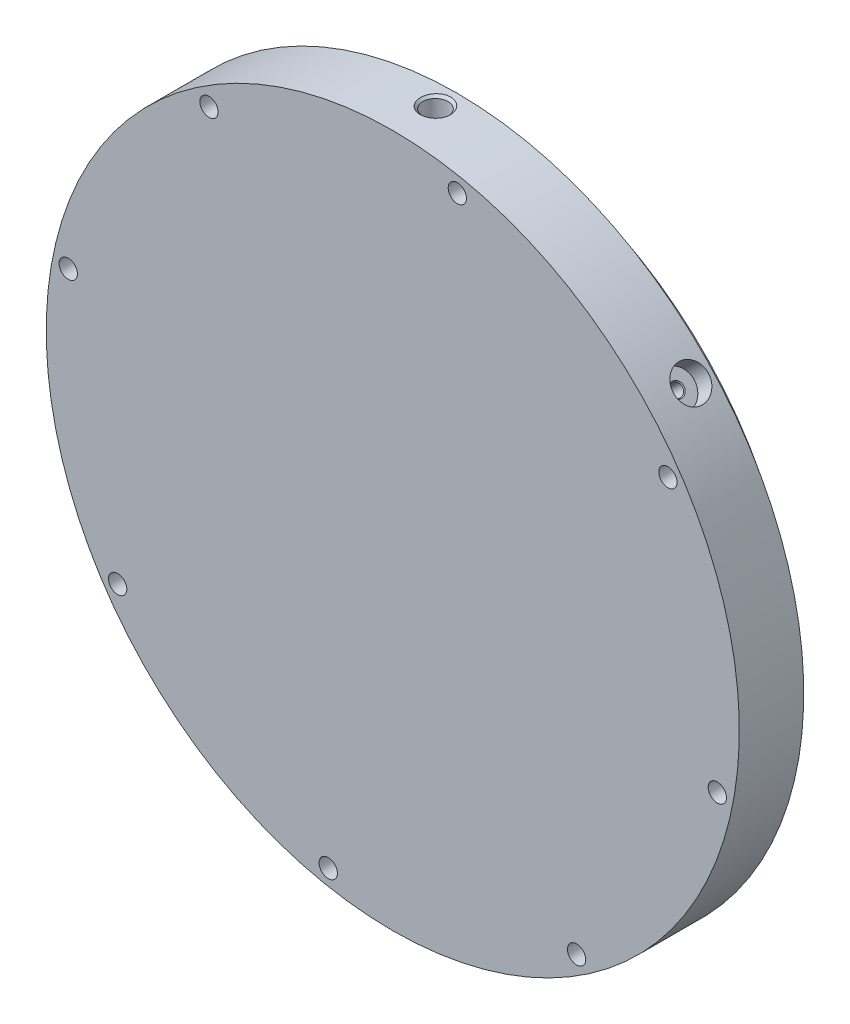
ISO-10303-21;
HEADER;
FILE_DESCRIPTION(('STEP AP214'),'2;1');
FILE_NAME('part.step','',(''),(''),'','','');
FILE_SCHEMA(('AUTOMOTIVE_DESIGN { 1 0 10303 214 1 1 1 1 }'));
ENDSEC;
DATA;
#1=APPLICATION_CONTEXT('core data for automotive mechanical design processes');
#2=APPLICATION_PROTOCOL_DEFINITION('international standard','automotive_design',2000,#1);
#3=PRODUCT_CONTEXT('',#1,'mechanical');
#4=PRODUCT('Part','Part','',(#3));
#5=PRODUCT_RELATED_PRODUCT_CATEGORY('part','',(#4));
#6=PRODUCT_DEFINITION_FORMATION('','',#4);
#7=PRODUCT_DEFINITION_CONTEXT('part definition',#1,'design');
#8=PRODUCT_DEFINITION('design','',#6,#7);
#9=PRODUCT_DEFINITION_SHAPE('','',#8);
#10=(LENGTH_UNIT() NAMED_UNIT(*) SI_UNIT(.MILLI.,.METRE.));
#11=(NAMED_UNIT(*) PLANE_ANGLE_UNIT() SI_UNIT($,.RADIAN.));
#12=(NAMED_UNIT(*) SI_UNIT($,.STERADIAN.) SOLID_ANGLE_UNIT());
#13=UNCERTAINTY_MEASURE_WITH_UNIT(LENGTH_MEASURE(1.E-05),#10,'distance_accuracy_value','');
#14=(GEOMETRIC_REPRESENTATION_CONTEXT(3) GLOBAL_UNCERTAINTY_ASSIGNED_CONTEXT((#13)) GLOBAL_UNIT_ASSIGNED_CONTEXT((#10,
#11,#12)) REPRESENTATION_CONTEXT('',''));
#15=CARTESIAN_POINT('',(0.,0.,0.));
#16=DIRECTION('',(0.,0.,1.));
#17=DIRECTION('',(1.,0.,0.));
#18=AXIS2_PLACEMENT_3D('',#15,#16,#17);
#19=CARTESIAN_POINT('',(0.,-3.65646478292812E-06,-209.5));
#20=DIRECTION('',(0.,-1.74532925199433E-08,-1.));
#21=DIRECTION('',(0.,-1.,1.74532925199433E-08));
#22=AXIS2_PLACEMENT_3D('',#19,#20,#21);
#23=PLANE('',#22);
#24=CARTESIAN_POINT('',(0.,-3.65646478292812E-06,-209.5));
#25=DIRECTION('',(0.,1.74532925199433E-08,1.));
#26=DIRECTION('',(0.,-1.,1.74532925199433E-08));
#27=AXIS2_PLACEMENT_3D('',#24,#25,#26);
#28=CIRCLE('',#27,199.);
#29=CARTESIAN_POINT('',(0.,198.999996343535,-209.500003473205));
#30=VERTEX_POINT('',#29);
#31=EDGE_CURVE('E11',#30,#30,#28,.T.);
#32=ORIENTED_EDGE('',*,*,#31,.T.);
#33=EDGE_LOOP('',(#32));
#34=FACE_BOUND('',#33,.T.);
#35=CARTESIAN_POINT('',(-105.5583442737,157.979222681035,-209.500002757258));
#36=DIRECTION('',(0.,1.74532925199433E-08,1.));
#37=DIRECTION('',(-1.,0.,0.));
#38=AXIS2_PLACEMENT_3D('',#35,#36,#37);
#39=CIRCLE('',#38,5.25);
#40=CARTESIAN_POINT('',(-100.3083442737,157.979222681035,-209.500002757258));
#41=VERTEX_POINT('',#40);
#42=EDGE_CURVE('E170',#41,#41,#39,.T.);
#43=ORIENTED_EDGE('',*,*,#42,.F.);
#44=EDGE_LOOP('',(#43));
#45=FACE_BOUND('',#44,.T.);
#46=CARTESIAN_POINT('',(37.06716118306,186.349199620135,-209.500003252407));
#47=DIRECTION('',(0.,1.74532925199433E-08,1.));
#48=DIRECTION('',(1.,0.,0.));
#49=AXIS2_PLACEMENT_3D('',#46,#47,#48);
#50=CIRCLE('',#49,5.25);
#51=CARTESIAN_POINT('',(42.31716118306,186.349199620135,-209.500003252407));
#52=VERTEX_POINT('',#51);
#53=EDGE_CURVE('E166',#52,#52,#50,.T.);
#54=ORIENTED_EDGE('',*,*,#53,.F.);
#55=EDGE_LOOP('',(#54));
#56=FACE_BOUND('',#55,.T.);
#57=CARTESIAN_POINT('',(157.9792263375,105.558340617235,-209.50000184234));
#58=DIRECTION('',(0.,1.74532925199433E-08,1.));
#59=DIRECTION('',(1.,0.,0.));
#60=AXIS2_PLACEMENT_3D('',#57,#58,#59);
#61=CIRCLE('',#60,5.25);
#62=CARTESIAN_POINT('',(163.2292263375,105.558340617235,-209.50000184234));
#63=VERTEX_POINT('',#62);
#64=EDGE_CURVE('E163',#63,#63,#61,.T.);
#65=ORIENTED_EDGE('',*,*,#64,.F.);
#66=EDGE_LOOP('',(#65));
#67=FACE_BOUND('',#66,.T.);
#68=CARTESIAN_POINT('',(186.3492032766,-37.0671648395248,-209.499999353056));
#69=DIRECTION('',(0.,1.74532925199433E-08,1.));
#70=DIRECTION('',(1.,0.,0.));
#71=AXIS2_PLACEMENT_3D('',#68,#69,#70);
#72=CIRCLE('',#71,5.25);
#73=CARTESIAN_POINT('',(191.5992032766,-37.0671648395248,-209.499999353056));
#74=VERTEX_POINT('',#73);
#75=EDGE_CURVE('E167',#74,#74,#72,.T.);
#76=ORIENTED_EDGE('',*,*,#75,.F.);
#77=EDGE_LOOP('',(#76));
#78=FACE_BOUND('',#77,.T.);
#79=CARTESIAN_POINT('',(105.5583442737,-157.979229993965,-209.499997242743));
#80=DIRECTION('',(0.,1.74532925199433E-08,1.));
#81=DIRECTION('',(1.,0.,0.));
#82=AXIS2_PLACEMENT_3D('',#79,#80,#81);
#83=CIRCLE('',#82,5.25);
#84=CARTESIAN_POINT('',(110.8083442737,-157.979229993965,-209.499997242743));
#85=VERTEX_POINT('',#84);
#86=EDGE_CURVE('E173',#85,#85,#83,.T.);
#87=ORIENTED_EDGE('',*,*,#86,.F.);
#88=EDGE_LOOP('',(#87));
#89=FACE_BOUND('',#88,.T.);
#90=CARTESIAN_POINT('',(-37.06716118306,-186.349206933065,-209.499996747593));
#91=DIRECTION('',(0.,1.74532925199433E-08,1.));
#92=DIRECTION('',(1.,0.,0.));
#93=AXIS2_PLACEMENT_3D('',#90,#91,#92);
#94=CIRCLE('',#93,5.25);
#95=CARTESIAN_POINT('',(-31.81716118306,-186.349206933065,-209.499996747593));
#96=VERTEX_POINT('',#95);
#97=EDGE_CURVE('E186',#96,#96,#94,.T.);
#98=ORIENTED_EDGE('',*,*,#97,.F.);
#99=EDGE_LOOP('',(#98));
#100=FACE_BOUND('',#99,.T.);
#101=CARTESIAN_POINT('',(-157.9792263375,-105.558347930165,-209.499998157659));
#102=DIRECTION('',(0.,1.74532925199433E-08,1.));
#103=DIRECTION('',(-1.,0.,0.));
#104=AXIS2_PLACEMENT_3D('',#101,#102,#103);
#105=CIRCLE('',#104,5.25);
#106=CARTESIAN_POINT('',(-152.7292263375,-105.558347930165,-209.499998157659));
#107=VERTEX_POINT('',#106);
#108=EDGE_CURVE('E183',#107,#107,#105,.T.);
#109=ORIENTED_EDGE('',*,*,#108,.F.);
#110=EDGE_LOOP('',(#109));
#111=FACE_BOUND('',#110,.T.);
#112=CARTESIAN_POINT('',(-186.3492032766,37.0671575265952,-209.500000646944));
#113=DIRECTION('',(0.,1.74532925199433E-08,1.));
#114=DIRECTION('',(1.,0.,0.));
#115=AXIS2_PLACEMENT_3D('',#112,#113,#114);
#116=CIRCLE('',#115,5.25);
#117=CARTESIAN_POINT('',(-181.0992032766,37.0671575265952,-209.500000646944));
#118=VERTEX_POINT('',#117);
#119=EDGE_CURVE('E187',#118,#118,#116,.T.);
#120=ORIENTED_EDGE('',*,*,#119,.F.);
#121=EDGE_LOOP('',(#120));
#122=FACE_BOUND('',#121,.T.);
#123=ADVANCED_FACE('F17',(#34,#45,#56,#67,#78,#89,#100,#111,#122),#23,.F.);
#124=CARTESIAN_POINT('',(0.,-4.61465054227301E-06,-264.4));
#125=DIRECTION('',(0.,1.74532925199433E-08,1.));
#126=DIRECTION('',(0.,1.,-1.74532925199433E-08));
#127=AXIS2_PLACEMENT_3D('',#124,#125,#126);
#128=CYLINDRICAL_SURFACE('',#127,199.);
#129=CARTESIAN_POINT('',(-4.28298516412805,198.953900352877,-226.422801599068));
#130=CARTESIAN_POINT('',(-4.09720336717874,198.95790165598,-226.313173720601));
#131=CARTESIAN_POINT('',(-3.90723713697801,198.961729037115,-226.21062671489));
#132=CARTESIAN_POINT('',(-3.52005638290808,198.96895466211,-226.020286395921));
#133=CARTESIAN_POINT('',(-3.32284222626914,198.972352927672,-225.932492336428));
#134=CARTESIAN_POINT('',(-2.9221986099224,198.978640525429,-225.772211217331));
#135=CARTESIAN_POINT('',(-2.71876704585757,198.98152968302,-225.699729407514));
#136=CARTESIAN_POINT('',(-2.30692925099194,198.986730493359,-225.570580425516));
#137=CARTESIAN_POINT('',(-2.09852275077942,198.989042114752,-225.513914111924));
#138=CARTESIAN_POINT('',(-1.65648381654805,198.993236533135,-225.411821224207));
#139=CARTESIAN_POINT('',(-1.42244735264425,198.995051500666,-225.368131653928));
#140=CARTESIAN_POINT('',(-0.951413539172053,198.99786115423,-225.300774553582));
#141=CARTESIAN_POINT('',(-0.714415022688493,198.998855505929,-225.277115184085));
#142=CARTESIAN_POINT('',(-0.239399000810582,198.999993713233,-225.250048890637));
#143=CARTESIAN_POINT('',(-0.00138216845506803,199.000138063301,-225.246630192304));
#144=CARTESIAN_POINT('',(0.474167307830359,198.999573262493,-225.260045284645));
#145=CARTESIAN_POINT('',(0.711699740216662,198.998863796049,-225.276886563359));
#146=CARTESIAN_POINT('',(1.18212198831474,198.996622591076,-225.330427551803));
#147=CARTESIAN_POINT('',(1.41503448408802,198.995099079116,-225.366928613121));
#148=CARTESIAN_POINT('',(1.87704777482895,198.991277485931,-225.459382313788));
#149=CARTESIAN_POINT('',(2.10614714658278,198.988979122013,-225.515342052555));
#150=CARTESIAN_POINT('',(2.55878965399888,198.983673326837,-225.646249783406));
#151=CARTESIAN_POINT('',(2.7823340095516,198.980666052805,-225.721193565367));
#152=CARTESIAN_POINT('',(3.22245404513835,198.974025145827,-225.889516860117));
#153=CARTESIAN_POINT('',(3.43902710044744,198.970391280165,-225.982903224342));
#154=CARTESIAN_POINT('',(3.8645179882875,198.962582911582,-226.187792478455));
#155=CARTESIAN_POINT('',(4.07340052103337,198.95840623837,-226.299368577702));
#156=CARTESIAN_POINT('',(4.48122712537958,198.949638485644,-226.539548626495));
#157=CARTESIAN_POINT('',(4.68016747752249,198.945047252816,-226.668158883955));
#158=CARTESIAN_POINT('',(5.06666652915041,198.935579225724,-226.941376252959));
#159=CARTESIAN_POINT('',(5.25422770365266,198.930702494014,-227.085979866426));
#160=CARTESIAN_POINT('',(5.61680188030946,198.920795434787,-227.390141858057));
#161=CARTESIAN_POINT('',(5.79181461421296,198.915765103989,-227.549700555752));
#162=CARTESIAN_POINT('',(6.13106335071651,198.905600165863,-227.885475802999));
#163=CARTESIAN_POINT('',(6.29506307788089,198.900465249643,-228.061931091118));
#164=CARTESIAN_POINT('',(6.60780431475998,198.89032106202,-228.427750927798));
#165=CARTESIAN_POINT('',(6.75655220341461,198.885311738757,-228.617110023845));
#166=CARTESIAN_POINT('',(7.03800817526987,198.875550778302,-229.007553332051));
#167=CARTESIAN_POINT('',(7.17070765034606,198.870799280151,-229.208643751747));
#168=CARTESIAN_POINT('',(7.41910991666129,198.861687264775,-229.62097105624));
#169=CARTESIAN_POINT('',(7.53481856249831,198.857326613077,-229.832204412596));
#170=CARTESIAN_POINT('',(7.7508472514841,198.849024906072,-230.267976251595));
#171=CARTESIAN_POINT('',(7.85079137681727,198.845094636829,-230.492701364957));
#172=CARTESIAN_POINT('',(8.03162792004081,198.837872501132,-230.949608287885));
#173=CARTESIAN_POINT('',(8.11252681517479,198.8345804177,-231.1817875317));
#174=CARTESIAN_POINT('',(8.25484516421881,198.82872277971,-231.652138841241));
#175=CARTESIAN_POINT('',(8.31625774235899,198.826157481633,-231.890312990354));
#176=CARTESIAN_POINT('',(8.41917198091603,198.821826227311,-232.370841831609));
#177=CARTESIAN_POINT('',(8.460680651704,198.820059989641,-232.613195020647));
#178=CARTESIAN_POINT('',(8.52407405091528,198.817352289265,-233.104422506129));
#179=CARTESIAN_POINT('',(8.54563270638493,198.816424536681,-233.353339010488));
#180=CARTESIAN_POINT('',(8.5678295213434,198.815469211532,-233.85201493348));
#181=CARTESIAN_POINT('',(8.56847512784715,198.815441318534,-234.10177402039));
#182=CARTESIAN_POINT('',(8.5488580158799,198.816285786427,-234.600557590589));
#183=CARTESIAN_POINT('',(8.52858774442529,198.817158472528,-234.849581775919));
#184=CARTESIAN_POINT('',(8.46726341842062,198.819779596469,-235.344957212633));
#185=CARTESIAN_POINT('',(8.426217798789,198.821527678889,-235.591309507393));
#186=CARTESIAN_POINT('',(8.32822098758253,198.825655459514,-236.057732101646));
#187=CARTESIAN_POINT('',(8.27303048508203,198.827964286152,-236.278174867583));
#188=CARTESIAN_POINT('',(8.14594582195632,198.8332114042,-236.714171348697));
#189=CARTESIAN_POINT('',(8.07405299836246,198.836149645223,-236.929725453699));
#190=CARTESIAN_POINT('',(7.91392895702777,198.842587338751,-237.354684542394));
#191=CARTESIAN_POINT('',(7.82569672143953,198.846086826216,-237.564089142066));
#192=CARTESIAN_POINT('',(7.63337011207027,198.853561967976,-237.975510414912));
#193=CARTESIAN_POINT('',(7.52927339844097,198.857537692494,-238.177525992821));
#194=CARTESIAN_POINT('',(7.41749423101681,198.861708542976,-238.375203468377));
#195=B_SPLINE_CURVE_WITH_KNOTS('',3,(#129,#130,#131,#132,#133,#134,#135,#136,#137,#138,#139,
#140,#141,#142,#143,#144,#145,#146,#147,#148,#149,#150,#151,#152,#153,#154,#155,#156,#157,#158,
#159,#160,#161,#162,#163,#164,#165,#166,#167,#168,#169,#170,#171,#172,#173,#174,#175,#176,#177,
#178,#179,#180,#181,#182,#183,#184,#185,#186,#187,#188,#189,#190,#191,#192,#193,#194),
.UNSPECIFIED.,.F.,.F.,(4,2,2,2,2,2,2,2,2,2,2,2,2,2,2,2,2,2,2,2,2,2,2,2,2,2,2,2,2,2,2,2,4),(0.,
0.647105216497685,1.2941776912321,1.94147165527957,2.58880075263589,3.3021856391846,
4.01586102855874,4.72912121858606,5.44264510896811,6.14909100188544,6.85579490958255,
7.56234222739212,8.26915252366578,8.97888117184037,9.68887337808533,10.3987106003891,
11.1085629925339,11.8305884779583,12.5523107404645,13.2744184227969,13.9962766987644,
14.733355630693,15.4701835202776,16.207271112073,16.9440989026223,17.6927674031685,
18.4411693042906,19.189841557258,19.9382100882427,20.6193309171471,21.3003972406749,
21.9815060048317,22.6627153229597),.UNSPECIFIED.);
#196=CARTESIAN_POINT('',(8.565570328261,198.81556624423,-234.000003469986));
#197=VERTEX_POINT('',#196);
#198=CARTESIAN_POINT('',(1.625082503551E-12,198.999996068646,-225.250003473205));
#199=VERTEX_POINT('',#198);
#200=EDGE_CURVE('E33',#197,#199,#195,.F.);
#201=ORIENTED_EDGE('',*,*,#200,.T.);
#202=CARTESIAN_POINT('',(-7.4174942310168,198.861708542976,-238.375203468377));
#203=CARTESIAN_POINT('',(-7.52238912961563,198.857794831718,-238.189694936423));
#204=CARTESIAN_POINT('',(-7.62052173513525,198.854052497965,-238.000367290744));
#205=CARTESIAN_POINT('',(-7.80283783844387,198.846982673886,-237.615142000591));
#206=CARTESIAN_POINT('',(-7.88702371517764,198.843655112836,-237.419245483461));
#207=CARTESIAN_POINT('',(-8.04107921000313,198.837484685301,-237.021831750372));
#208=CARTESIAN_POINT('',(-8.11094486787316,198.834641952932,-236.820312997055));
#209=CARTESIAN_POINT('',(-8.23601745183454,198.829500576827,-236.412751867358));
#210=CARTESIAN_POINT('',(-8.29122263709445,198.827201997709,-236.206708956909));
#211=CARTESIAN_POINT('',(-8.3946946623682,198.822862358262,-235.756430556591));
#212=CARTESIAN_POINT('',(-8.44025904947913,198.820928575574,-235.511568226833));
#213=CARTESIAN_POINT('',(-8.5107819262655,198.81792224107,-235.018794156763));
#214=CARTESIAN_POINT('',(-8.53573174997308,198.816850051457,-234.770881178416));
#215=CARTESIAN_POINT('',(-8.56483974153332,198.81559825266,-234.273884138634));
#216=CARTESIAN_POINT('',(-8.56900217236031,198.815418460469,-234.024800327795));
#217=CARTESIAN_POINT('',(-8.55651806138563,198.815956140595,-233.527063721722));
#218=CARTESIAN_POINT('',(-8.53986376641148,198.816673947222,-233.27841112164));
#219=CARTESIAN_POINT('',(-8.48564568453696,198.8189954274,-232.781628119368));
#220=CARTESIAN_POINT('',(-8.44793567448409,198.820605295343,-232.533513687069));
#221=CARTESIAN_POINT('',(-8.35172271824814,198.82467008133,-232.041259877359));
#222=CARTESIAN_POINT('',(-8.29321202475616,198.827125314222,-231.797122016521));
#223=CARTESIAN_POINT('',(-8.15579155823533,198.832809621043,-231.314743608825));
#224=CARTESIAN_POINT('',(-8.07688792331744,198.836038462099,-231.076501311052));
#225=CARTESIAN_POINT('',(-7.89914484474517,198.843178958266,-230.607481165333));
#226=CARTESIAN_POINT('',(-7.80029809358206,198.847090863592,-230.376706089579));
#227=CARTESIAN_POINT('',(-7.58375431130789,198.855467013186,-229.92530069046));
#228=CARTESIAN_POINT('',(-7.4661328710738,198.85992902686,-229.704634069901));
#229=CARTESIAN_POINT('',(-7.21248532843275,198.86929016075,-229.274040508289));
#230=CARTESIAN_POINT('',(-7.07645238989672,198.874189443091,-229.064117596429));
#231=CARTESIAN_POINT('',(-6.78698770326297,198.884278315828,-228.656783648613));
#232=CARTESIAN_POINT('',(-6.63356422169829,198.889467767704,-228.459366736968));
#233=CARTESIAN_POINT('',(-6.31025274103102,198.899988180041,-228.078390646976));
#234=CARTESIAN_POINT('',(-6.14035877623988,198.905319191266,-227.89483653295));
#235=CARTESIAN_POINT('',(-5.7880105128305,198.915881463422,-227.545779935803));
#236=CARTESIAN_POINT('',(-5.60578652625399,198.921113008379,-227.380045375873));
#237=CARTESIAN_POINT('',(-5.22780467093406,198.931406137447,-227.064759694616));
#238=CARTESIAN_POINT('',(-5.03204181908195,198.936467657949,-226.915214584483));
#239=CARTESIAN_POINT('',(-4.42658554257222,198.951164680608,-226.492869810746));
#240=CARTESIAN_POINT('',(-3.99831546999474,198.96032542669,-226.245955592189));
#241=CARTESIAN_POINT('',(-3.11499637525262,198.97609487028,-225.834569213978));
#242=CARTESIAN_POINT('',(-2.66069411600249,198.982752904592,-225.6684818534));
#243=CARTESIAN_POINT('',(-1.73035299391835,198.993015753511,-225.416399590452));
#244=CARTESIAN_POINT('',(-1.25431942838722,198.996621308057,-225.330385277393));
#245=CARTESIAN_POINT('',(-0.302961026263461,199.000324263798,-225.242105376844));
#246=CARTESIAN_POINT('',(0.172231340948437,199.000481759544,-225.238405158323));
#247=CARTESIAN_POINT('',(1.11645809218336,198.997424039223,-225.31120746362));
#248=CARTESIAN_POINT('',(1.58549238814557,198.994208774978,-225.387711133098));
#249=CARTESIAN_POINT('',(2.43745743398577,198.985456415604,-225.601724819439));
#250=CARTESIAN_POINT('',(2.82302859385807,198.980322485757,-225.728808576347));
#251=CARTESIAN_POINT('',(3.38441284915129,198.971302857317,-225.959608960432));
#252=CARTESIAN_POINT('',(3.56870580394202,198.968076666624,-226.043234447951));
#253=CARTESIAN_POINT('',(3.93086654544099,198.961251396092,-226.223426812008));
#254=CARTESIAN_POINT('',(4.10873376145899,198.957652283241,-226.319994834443));
#255=CARTESIAN_POINT('',(4.28298516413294,198.953900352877,-226.422801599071));
#256=B_SPLINE_CURVE_WITH_KNOTS('',3,(#202,#203,#204,#205,#206,#207,#208,#209,#210,#211,#212,
#213,#214,#215,#216,#217,#218,#219,#220,#221,#222,#223,#224,#225,#226,#227,#228,#229,#230,#231,
#232,#233,#234,#235,#236,#237,#238,#239,#240,#241,#242,#243,#244,#245,#246,#247,#248,#249,#250,
#251,#252,#253,#254,#255),.UNSPECIFIED.,.F.,.F.,(4,2,2,2,2,2,2,2,2,2,2,2,2,2,2,2,2,2,2,2,2,2,2,
2,2,2,4),(0.,0.639290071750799,1.2784709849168,1.91782842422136,2.5572617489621,
3.30358451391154,4.0502208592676,4.79670408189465,5.54346541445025,6.29547837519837,
7.0477717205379,7.79983889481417,8.55218214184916,9.3015693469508,10.0512355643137,
10.8005469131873,11.5501306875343,12.2883147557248,13.0267719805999,14.5019817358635,
15.9463592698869,17.3903865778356,18.8092262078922,20.2280861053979,21.4416915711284,
22.0484502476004,22.6552626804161),.UNSPECIFIED.);
#257=CARTESIAN_POINT('',(-8.565570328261,198.81556624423,-234.000003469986));
#258=VERTEX_POINT('',#257);
#259=EDGE_CURVE('E199',#199,#258,#256,.F.);
#260=ORIENTED_EDGE('',*,*,#259,.T.);
#261=CARTESIAN_POINT('',(4.28298516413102,198.953900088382,-241.577205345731));
#262=CARTESIAN_POINT('',(4.09720336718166,198.957901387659,-241.686833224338));
#263=CARTESIAN_POINT('',(3.90723713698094,198.961728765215,-241.789380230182));
#264=CARTESIAN_POINT('',(3.52005638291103,198.968954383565,-241.979720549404));
#265=CARTESIAN_POINT('',(3.32284222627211,198.972352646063,-242.067514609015));
#266=CARTESIAN_POINT('',(2.92219860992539,198.978640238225,-242.227795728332));
#267=CARTESIAN_POINT('',(2.71876704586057,198.981529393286,-242.300277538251));
#268=CARTESIAN_POINT('',(2.30692925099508,198.986730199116,-242.42942652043));
#269=CARTESIAN_POINT('',(2.09852275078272,198.989041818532,-242.486092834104));
#270=CARTESIAN_POINT('',(1.65648381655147,198.993236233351,-242.588185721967));
#271=CARTESIAN_POINT('',(1.42244735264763,198.995051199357,-242.631875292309));
#272=CARTESIAN_POINT('',(0.951413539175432,198.99786085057,-242.699232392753));
#273=CARTESIAN_POINT('',(0.714415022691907,198.998855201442,-242.722891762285));
#274=CARTESIAN_POINT('',(0.239399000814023,198.999993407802,-242.749958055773));
#275=CARTESIAN_POINT('',(0.00138216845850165,199.000137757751,-242.753376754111));
#276=CARTESIAN_POINT('',(-0.474167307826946,198.999572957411,-242.739961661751));
#277=CARTESIAN_POINT('',(-0.711699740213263,198.998863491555,-242.723120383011));
#278=CARTESIAN_POINT('',(-1.18212198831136,198.996622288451,-242.66957939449));
#279=CARTESIAN_POINT('',(-1.41503448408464,198.995098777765,-242.633078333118));
#280=CARTESIAN_POINT('',(-1.87704777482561,198.991277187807,-242.540624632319));
#281=CARTESIAN_POINT('',(-2.10614714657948,198.988978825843,-242.484664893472));
#282=CARTESIAN_POINT('',(-2.55878965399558,198.983673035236,-242.353757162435));
#283=CARTESIAN_POINT('',(-2.78233400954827,198.98066576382,-242.278813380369));
#284=CARTESIAN_POINT('',(-3.22245404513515,198.974024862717,-242.110490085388));
#285=CARTESIAN_POINT('',(-3.43902710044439,198.970391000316,-242.017103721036));
#286=CARTESIAN_POINT('',(-3.86451798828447,198.962582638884,-241.812214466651));
#287=CARTESIAN_POINT('',(-4.07340052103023,198.958405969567,-241.700638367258));
#288=CARTESIAN_POINT('',(-4.48122712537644,198.949638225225,-241.460458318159));
#289=CARTESIAN_POINT('',(-4.68016747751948,198.945046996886,-241.331848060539));
#290=CARTESIAN_POINT('',(-5.06666652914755,198.935578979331,-241.058630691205));
#291=CARTESIAN_POINT('',(-5.25422770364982,198.93070225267,-240.914027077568));
#292=CARTESIAN_POINT('',(-5.61680188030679,198.920795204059,-240.609865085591));
#293=CARTESIAN_POINT('',(-5.79181461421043,198.91576487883,-240.450306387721));
#294=CARTESIAN_POINT('',(-6.1310633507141,198.905599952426,-240.114531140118));
#295=CARTESIAN_POINT('',(-6.29506307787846,198.900465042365,-239.93807585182));
#296=CARTESIAN_POINT('',(-6.60780431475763,198.890320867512,-239.572256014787));
#297=CARTESIAN_POINT('',(-6.75655220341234,198.885311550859,-239.382896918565));
#298=CARTESIAN_POINT('',(-7.03800817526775,198.875550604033,-238.992453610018));
#299=CARTESIAN_POINT('',(-7.17070765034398,198.870799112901,-238.791363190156));
#300=CARTESIAN_POINT('',(-7.41910991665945,198.861687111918,-238.379035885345));
#301=CARTESIAN_POINT('',(-7.53481856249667,198.857326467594,-238.167802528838));
#302=CARTESIAN_POINT('',(-7.75084725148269,198.849024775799,-237.732030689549));
#303=CARTESIAN_POINT('',(-7.85079137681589,198.845094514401,-237.507305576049));
#304=CARTESIAN_POINT('',(-8.03162792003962,198.837872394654,-237.050398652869));
#305=CARTESIAN_POINT('',(-8.11252681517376,198.834580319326,-236.818219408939));
#306=CARTESIAN_POINT('',(-8.25484516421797,198.828722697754,-236.347868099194));
#307=CARTESIAN_POINT('',(-8.31625774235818,198.826157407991,-236.109693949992));
#308=CARTESIAN_POINT('',(-8.41917198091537,198.821826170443,-235.629165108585));
#309=CARTESIAN_POINT('',(-8.46068065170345,198.820059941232,-235.386811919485));
#310=CARTESIAN_POINT('',(-8.52407405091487,198.817352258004,-234.89558443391));
#311=CARTESIAN_POINT('',(-8.54563270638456,198.816424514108,-234.646667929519));
#312=CARTESIAN_POINT('',(-8.56782952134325,198.815469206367,-234.147992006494));
#313=CARTESIAN_POINT('',(-8.56847512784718,198.815441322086,-233.898232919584));
#314=CARTESIAN_POINT('',(-8.54885801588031,198.81628580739,-233.399449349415));
#315=CARTESIAN_POINT('',(-8.52858774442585,198.817158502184,-233.150425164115));
#316=CARTESIAN_POINT('',(-8.46726341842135,198.819779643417,-232.655049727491));
#317=CARTESIAN_POINT('',(-8.42621779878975,198.821527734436,-232.408697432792));
#318=CARTESIAN_POINT('',(-8.32822098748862,198.825655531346,-231.942274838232));
#319=CARTESIAN_POINT('',(-8.27303048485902,198.827964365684,-231.721832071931));
#320=CARTESIAN_POINT('',(-8.14594582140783,198.833211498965,-231.285835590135));
#321=CARTESIAN_POINT('',(-8.07405299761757,198.83614974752,-231.070281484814));
#322=CARTESIAN_POINT('',(-7.91392895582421,198.8425874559,-230.645322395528));
#323=CARTESIAN_POINT('',(-7.82569671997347,198.846086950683,-230.435917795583));
#324=CARTESIAN_POINT('',(-7.63337011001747,198.853562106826,-230.024496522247));
#325=CARTESIAN_POINT('',(-7.52927339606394,198.857537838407,-229.822480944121));
#326=CARTESIAN_POINT('',(-7.41749422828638,198.861708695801,-229.624803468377));
#327=B_SPLINE_CURVE_WITH_KNOTS('',3,(#261,#262,#263,#264,#265,#266,#267,#268,#269,#270,#271,
#272,#273,#274,#275,#276,#277,#278,#279,#280,#281,#282,#283,#284,#285,#286,#287,#288,#289,#290,
#291,#292,#293,#294,#295,#296,#297,#298,#299,#300,#301,#302,#303,#304,#305,#306,#307,#308,#309,
#310,#311,#312,#313,#314,#315,#316,#317,#318,#319,#320,#321,#322,#323,#324,#325,#326),
.UNSPECIFIED.,.F.,.F.,(4,2,2,2,2,2,2,2,2,2,2,2,2,2,2,2,2,2,2,2,2,2,2,2,2,2,2,2,2,2,2,2,4),(0.,
0.647105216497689,1.29417769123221,1.94147165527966,2.58880075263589,3.30218563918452,
4.01586102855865,4.72912121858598,5.44264510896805,6.14909100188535,6.85579490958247,
7.56234222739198,8.26915252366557,8.97888117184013,9.68887337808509,10.3987106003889,
11.1085629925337,11.830588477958,12.5523107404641,13.2744184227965,13.996276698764,
14.7333556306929,15.4701835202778,16.2072711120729,16.9440989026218,17.6927674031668,
18.4411693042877,19.1898415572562,19.9382100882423,20.6193309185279,21.3003972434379,
21.9815060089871,22.6627153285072),.UNSPECIFIED.);
#328=CARTESIAN_POINT('',(3.486035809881E-13,198.999995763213,-242.750003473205));
#329=VERTEX_POINT('',#328);
#330=EDGE_CURVE('E222',#258,#329,#327,.F.);
#331=ORIENTED_EDGE('',*,*,#330,.T.);
#332=CARTESIAN_POINT('',(7.41749422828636,198.861708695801,-229.624803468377));
#333=CARTESIAN_POINT('',(7.52238912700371,198.857794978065,-229.810312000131));
#334=CARTESIAN_POINT('',(7.62052173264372,198.854052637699,-229.999639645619));
#335=CARTESIAN_POINT('',(7.80283783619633,198.846982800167,-230.384864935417));
#336=CARTESIAN_POINT('',(7.88702371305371,198.843655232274,-230.58076145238));
#337=CARTESIAN_POINT('',(8.04107920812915,198.837484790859,-230.978175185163));
#338=CARTESIAN_POINT('',(8.11094486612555,198.83464205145,-231.17969393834));
#339=CARTESIAN_POINT('',(8.23601745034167,198.829500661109,-231.587255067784));
#340=CARTESIAN_POINT('',(8.29122263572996,198.827202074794,-231.793297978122));
#341=CARTESIAN_POINT('',(8.39469466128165,198.822862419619,-232.243576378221));
#342=CARTESIAN_POINT('',(8.44025904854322,198.820928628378,-232.488438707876));
#343=CARTESIAN_POINT('',(8.51078192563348,198.81792227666,-232.981212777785));
#344=CARTESIAN_POINT('',(8.53573174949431,198.816850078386,-233.229125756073));
#345=CARTESIAN_POINT('',(8.56483974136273,198.815598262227,-233.726122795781));
#346=CARTESIAN_POINT('',(8.56900217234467,198.815418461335,-233.975206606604));
#347=CARTESIAN_POINT('',(8.55651806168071,198.815956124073,-234.472943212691));
#348=CARTESIAN_POINT('',(8.53986376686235,198.816673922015,-234.721595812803));
#349=CARTESIAN_POINT('',(8.48564568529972,198.818995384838,-235.218378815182));
#350=CARTESIAN_POINT('',(8.44793567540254,198.820605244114,-235.46649324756));
#351=CARTESIAN_POINT('',(8.35172271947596,198.824670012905,-235.958747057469));
#352=CARTESIAN_POINT('',(8.29321202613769,198.82712523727,-236.202884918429));
#353=CARTESIAN_POINT('',(8.15579155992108,198.83280952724,-236.685263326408));
#354=CARTESIAN_POINT('',(8.07688792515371,198.836038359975,-236.923505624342));
#355=CARTESIAN_POINT('',(7.89914484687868,198.84317883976,-237.392525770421));
#356=CARTESIAN_POINT('',(7.80029809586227,198.847090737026,-237.623300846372));
#357=CARTESIAN_POINT('',(7.5837543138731,198.855466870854,-238.074706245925));
#358=CARTESIAN_POINT('',(7.4661328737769,198.859928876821,-238.295372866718));
#359=CARTESIAN_POINT('',(7.21248533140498,198.869289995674,-238.725966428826));
#360=CARTESIAN_POINT('',(7.07645239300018,198.874189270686,-238.935889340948));
#361=CARTESIAN_POINT('',(6.78698770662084,198.8842781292,-239.343223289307));
#362=CARTESIAN_POINT('',(6.63356422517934,198.889467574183,-239.540640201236));
#363=CARTESIAN_POINT('',(6.31025274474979,198.89998797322,-239.921616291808));
#364=CARTESIAN_POINT('',(6.14035878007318,198.905318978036,-240.105170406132));
#365=CARTESIAN_POINT('',(5.78801051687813,198.915881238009,-240.454227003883));
#366=CARTESIAN_POINT('',(5.60578653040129,198.921112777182,-240.619961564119));
#367=CARTESIAN_POINT('',(5.22780467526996,198.931405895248,-240.935247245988));
#368=CARTESIAN_POINT('',(5.03204182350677,198.936467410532,-241.084792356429));
#369=CARTESIAN_POINT('',(4.42658554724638,198.951164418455,-241.507137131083));
#370=CARTESIAN_POINT('',(3.99831547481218,198.960325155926,-241.754051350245));
#371=CARTESIAN_POINT('',(3.11499638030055,198.976094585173,-242.165437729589));
#372=CARTESIAN_POINT('',(2.66069412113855,198.982752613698,-242.331525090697));
#373=CARTESIAN_POINT('',(1.7303529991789,198.993015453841,-242.583607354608));
#374=CARTESIAN_POINT('',(1.25431943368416,198.996621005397,-242.6696216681));
#375=CARTESIAN_POINT('',(0.302961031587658,199.000323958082,-242.757901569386));
#376=CARTESIAN_POINT('',(-0.172231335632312,199.000481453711,-242.761601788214));
#377=CARTESIAN_POINT('',(-1.11645808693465,198.997423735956,-242.688799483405));
#378=CARTESIAN_POINT('',(-1.58549238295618,198.994208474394,-242.612295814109));
#379=CARTESIAN_POINT('',(-2.43745742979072,198.985456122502,-242.398282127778));
#380=CARTESIAN_POINT('',(-2.82302859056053,198.980322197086,-242.271198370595));
#381=CARTESIAN_POINT('',(-3.38441284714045,198.971302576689,-242.040397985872));
#382=CARTESIAN_POINT('',(-3.56870580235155,198.96807638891,-241.956772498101));
#383=CARTESIAN_POINT('',(-3.93086654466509,198.961251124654,-241.776580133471));
#384=CARTESIAN_POINT('',(-4.10873376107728,198.957652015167,-241.680012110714));
#385=CARTESIAN_POINT('',(-4.28298516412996,198.953900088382,-241.577205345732));
#386=B_SPLINE_CURVE_WITH_KNOTS('',3,(#332,#333,#334,#335,#336,#337,#338,#339,#340,#341,#342,
#343,#344,#345,#346,#347,#348,#349,#350,#351,#352,#353,#354,#355,#356,#357,#358,#359,#360,#361,
#362,#363,#364,#365,#366,#367,#368,#369,#370,#371,#372,#373,#374,#375,#376,#377,#378,#379,#380,
#381,#382,#383,#384,#385),.UNSPECIFIED.,.F.,.F.,(4,2,2,2,2,2,2,2,2,2,2,2,2,2,2,2,2,2,2,2,2,2,2,
2,2,2,4),(0.,0.6392900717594,1.27847098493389,1.91782842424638,2.55726174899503,
3.30358451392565,4.05022085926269,4.79670408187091,5.54346541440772,6.29547837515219,
7.04777172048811,7.79983889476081,8.5521821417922,9.30156934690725,10.0512355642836,
10.8005469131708,11.5501306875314,12.2883147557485,13.0267719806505,14.5019817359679,
15.9463592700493,17.3903865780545,18.8092262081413,20.2280861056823,21.4416915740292,
22.0484502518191,22.6552626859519),.UNSPECIFIED.);
#387=EDGE_CURVE('E227',#329,#197,#386,.F.);
#388=ORIENTED_EDGE('',*,*,#387,.T.);
#389=EDGE_LOOP('',(#201,#260,#331,#388));
#390=FACE_BOUND('',#389,.T.);
#391=ORIENTED_EDGE('',*,*,#31,.F.);
#392=EDGE_LOOP('',(#391));
#393=FACE_BOUND('',#392,.T.);
#394=CARTESIAN_POINT('',(153.288729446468,126.899820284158,-234.00000221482));
#395=CARTESIAN_POINT('',(153.288730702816,126.899818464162,-233.719239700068));
#396=CARTESIAN_POINT('',(153.281177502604,126.908944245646,-233.438512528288));
#397=CARTESIAN_POINT('',(153.251008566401,126.945373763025,-232.87896251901));
#398=CARTESIAN_POINT('',(153.228388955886,126.97268217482,-232.600140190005));
#399=CARTESIAN_POINT('',(153.168184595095,127.045300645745,-232.046189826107));
#400=CARTESIAN_POINT('',(153.1305842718,127.090629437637,-231.771065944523));
#401=CARTESIAN_POINT('',(153.040642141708,127.198922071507,-231.226756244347));
#402=CARTESIAN_POINT('',(152.98830006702,127.261886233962,-230.957570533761));
#403=CARTESIAN_POINT('',(152.869218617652,127.404904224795,-230.427198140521));
#404=CARTESIAN_POINT('',(152.80248686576,127.484949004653,-230.166007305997));
#405=CARTESIAN_POINT('',(152.655008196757,127.661508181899,-229.653324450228));
#406=CARTESIAN_POINT('',(152.574261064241,127.758022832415,-229.401832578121));
#407=CARTESIAN_POINT('',(152.399258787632,127.966727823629,-228.910391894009));
#408=CARTESIAN_POINT('',(152.305006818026,128.078914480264,-228.670440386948));
#409=CARTESIAN_POINT('',(152.103553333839,128.318090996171,-228.203720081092));
#410=CARTESIAN_POINT('',(151.996352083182,128.445080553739,-227.976951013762));
#411=CARTESIAN_POINT('',(151.769550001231,128.712988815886,-227.537995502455));
#412=CARTESIAN_POINT('',(151.649938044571,128.853920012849,-227.325822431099));
#413=CARTESIAN_POINT('',(151.399132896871,129.148515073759,-226.917787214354));
#414=CARTESIAN_POINT('',(151.267939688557,129.302178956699,-226.721925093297));
#415=CARTESIAN_POINT('',(150.994785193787,129.621054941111,-226.347892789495));
#416=CARTESIAN_POINT('',(150.852823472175,129.786267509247,-226.169723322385));
#417=CARTESIAN_POINT('',(150.559033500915,130.126964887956,-225.832349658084));
#418=CARTESIAN_POINT('',(150.407205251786,130.30244969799,-225.673145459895));
#419=CARTESIAN_POINT('',(150.094574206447,130.662445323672,-225.374757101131));
#420=CARTESIAN_POINT('',(149.933766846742,130.846960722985,-225.235583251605));
#421=CARTESIAN_POINT('',(149.604294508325,131.223536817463,-224.978344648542));
#422=CARTESIAN_POINT('',(149.435629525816,131.415597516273,-224.860279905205));
#423=CARTESIAN_POINT('',(149.091556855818,131.805820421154,-224.646103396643));
#424=CARTESIAN_POINT('',(148.91614921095,132.003982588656,-224.549991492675));
#425=CARTESIAN_POINT('',(148.559766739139,132.404934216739,-224.380407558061));
#426=CARTESIAN_POINT('',(148.378791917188,132.607723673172,-224.306935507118));
#427=CARTESIAN_POINT('',(148.01266418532,133.016259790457,-224.183210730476));
#428=CARTESIAN_POINT('',(147.827514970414,133.222003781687,-224.132938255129));
#429=CARTESIAN_POINT('',(147.454168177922,133.635117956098,-224.055880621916));
#430=CARTESIAN_POINT('',(147.26597060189,133.842488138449,-224.029095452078));
#431=CARTESIAN_POINT('',(146.887847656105,134.257357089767,-223.99920470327));
#432=CARTESIAN_POINT('',(146.697922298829,134.464855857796,-223.996098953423));
#433=CARTESIAN_POINT('',(146.317692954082,134.878503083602,-224.013588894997));
#434=CARTESIAN_POINT('',(146.127388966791,135.084651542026,-224.034184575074));
#435=CARTESIAN_POINT('',(145.747945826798,135.493959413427,-224.098900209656));
#436=CARTESIAN_POINT('',(145.558805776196,135.697121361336,-224.142998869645));
#437=CARTESIAN_POINT('',(145.182895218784,136.099234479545,-224.254391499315));
#438=CARTESIAN_POINT('',(144.996124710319,136.298185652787,-224.321685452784));
#439=CARTESIAN_POINT('',(144.626329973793,136.69051276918,-224.478987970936));
#440=CARTESIAN_POINT('',(144.443305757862,136.883888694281,-224.568996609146));
#441=CARTESIAN_POINT('',(144.082369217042,137.263755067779,-224.771086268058));
#442=CARTESIAN_POINT('',(143.904456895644,137.450245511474,-224.883167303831));
#443=CARTESIAN_POINT('',(143.55500597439,137.815177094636,-225.128659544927));
#444=CARTESIAN_POINT('',(143.383470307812,137.993614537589,-225.262080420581));
#445=CARTESIAN_POINT('',(143.048165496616,138.341170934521,-225.549266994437));
#446=CARTESIAN_POINT('',(142.884396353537,138.510289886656,-225.703032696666));
#447=CARTESIAN_POINT('',(142.565884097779,138.838106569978,-226.029818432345));
#448=CARTESIAN_POINT('',(142.41114103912,138.996804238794,-226.202838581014));
#449=CARTESIAN_POINT('',(142.111884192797,139.302753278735,-226.566906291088));
#450=CARTESIAN_POINT('',(141.967370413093,139.450004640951,-226.757953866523));
#451=CARTESIAN_POINT('',(141.68955144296,139.7322767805,-227.156944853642));
#452=CARTESIAN_POINT('',(141.556258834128,139.867283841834,-227.364906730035));
#453=CARTESIAN_POINT('',(141.302117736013,140.124027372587,-227.79606798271));
#454=CARTESIAN_POINT('',(141.181269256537,140.245763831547,-228.019267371));
#455=CARTESIAN_POINT('',(140.952982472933,140.475199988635,-228.479321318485));
#456=CARTESIAN_POINT('',(140.845544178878,140.582899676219,-228.716175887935));
#457=CARTESIAN_POINT('',(140.644943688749,140.78358863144,-229.201860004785));
#458=CARTESIAN_POINT('',(140.551781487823,140.876577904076,-229.450689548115));
#459=CARTESIAN_POINT('',(140.380486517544,141.047270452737,-229.958566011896));
#460=CARTESIAN_POINT('',(140.30235425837,141.124973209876,-230.217613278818));
#461=CARTESIAN_POINT('',(140.161761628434,141.264607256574,-230.744076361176));
#462=CARTESIAN_POINT('',(140.099301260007,141.326538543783,-231.011492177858));
#463=CARTESIAN_POINT('',(139.990566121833,141.434246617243,-231.552787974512));
#464=CARTESIAN_POINT('',(139.944291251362,141.480023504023,-231.826667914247));
#465=CARTESIAN_POINT('',(139.868308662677,141.555140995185,-232.378942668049));
#466=CARTESIAN_POINT('',(139.83860092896,141.584481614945,-232.657337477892));
#467=CARTESIAN_POINT('',(139.796021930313,141.626522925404,-233.216351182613));
#468=CARTESIAN_POINT('',(139.783132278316,141.639241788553,-233.496967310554));
#469=CARTESIAN_POINT('',(139.774236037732,141.64802089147,-234.05872717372));
#470=CARTESIAN_POINT('',(139.778229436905,141.644081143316,-234.339870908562));
#471=CARTESIAN_POINT('',(139.803066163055,141.619567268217,-234.900684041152));
#472=CARTESIAN_POINT('',(139.823909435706,141.598993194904,-235.18035344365));
#473=CARTESIAN_POINT('',(139.882273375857,141.541337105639,-235.736228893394));
#474=CARTESIAN_POINT('',(139.919794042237,141.504255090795,-236.012434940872));
#475=CARTESIAN_POINT('',(140.011179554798,141.413834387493,-236.559279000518));
#476=CARTESIAN_POINT('',(140.065035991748,141.36050406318,-236.829919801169));
#477=CARTESIAN_POINT('',(140.188657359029,141.237908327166,-237.363859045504));
#478=CARTESIAN_POINT('',(140.25842228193,141.168642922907,-237.627157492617));
#479=CARTESIAN_POINT('',(140.413290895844,141.014603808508,-238.144547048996));
#480=CARTESIAN_POINT('',(140.498394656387,140.92983002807,-238.398638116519));
#481=CARTESIAN_POINT('',(140.683249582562,140.74529888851,-238.895812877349));
#482=CARTESIAN_POINT('',(140.78300076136,140.64554151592,-239.13889656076));
#483=CARTESIAN_POINT('',(140.996438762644,140.431570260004,-239.612542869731));
#484=CARTESIAN_POINT('',(141.110137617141,140.317343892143,-239.843094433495));
#485=CARTESIAN_POINT('',(141.350490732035,140.075217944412,-240.289816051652));
#486=CARTESIAN_POINT('',(141.477144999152,139.947318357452,-240.505986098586));
#487=CARTESIAN_POINT('',(141.742402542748,139.678651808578,-240.92241547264));
#488=CARTESIAN_POINT('',(141.881005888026,139.537884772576,-241.122674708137));
#489=CARTESIAN_POINT('',(142.16906823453,139.244379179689,-241.505862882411));
#490=CARTESIAN_POINT('',(142.318527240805,139.091640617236,-241.688791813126));
#491=CARTESIAN_POINT('',(142.627271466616,138.775030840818,-242.036178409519));
#492=CARTESIAN_POINT('',(142.786565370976,138.611149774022,-242.200619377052));
#493=CARTESIAN_POINT('',(143.113622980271,138.273442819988,-242.509671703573));
#494=CARTESIAN_POINT('',(143.281386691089,138.099616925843,-242.654283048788));
#495=CARTESIAN_POINT('',(143.624094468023,137.743164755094,-242.922645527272));
#496=CARTESIAN_POINT('',(143.7990385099,137.560538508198,-243.046396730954));
#497=CARTESIAN_POINT('',(144.15477668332,137.187701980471,-243.272156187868));
#498=CARTESIAN_POINT('',(144.335570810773,136.997491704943,-243.374164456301));
#499=CARTESIAN_POINT('',(144.701561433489,136.610862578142,-243.555665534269));
#500=CARTESIAN_POINT('',(144.886755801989,136.414446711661,-243.635168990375));
#501=CARTESIAN_POINT('',(145.260251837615,136.016662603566,-243.771155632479));
#502=CARTESIAN_POINT('',(145.448553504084,135.815294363,-243.82763882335));
#503=CARTESIAN_POINT('',(145.826878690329,135.409000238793,-243.917179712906));
#504=CARTESIAN_POINT('',(146.016902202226,135.204074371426,-243.950237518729));
#505=CARTESIAN_POINT('',(146.397291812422,134.792100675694,-243.992690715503));
#506=CARTESIAN_POINT('',(146.587657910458,134.585052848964,-244.002086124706));
#507=CARTESIAN_POINT('',(146.967158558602,134.170533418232,-243.997149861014));
#508=CARTESIAN_POINT('',(147.156294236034,133.963062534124,-243.982844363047));
#509=CARTESIAN_POINT('',(147.532211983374,133.548955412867,-243.930658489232));
#510=CARTESIAN_POINT('',(147.718994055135,133.342319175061,-243.892778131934));
#511=CARTESIAN_POINT('',(148.088906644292,132.931377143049,-243.793713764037));
#512=CARTESIAN_POINT('',(148.272037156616,132.727071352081,-243.732529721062));
#513=CARTESIAN_POINT('',(148.633392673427,132.322284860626,-243.587295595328));
#514=CARTESIAN_POINT('',(148.811617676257,132.121804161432,-243.503245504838));
#515=CARTESIAN_POINT('',(149.161961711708,131.72614732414,-243.312878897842));
#516=CARTESIAN_POINT('',(149.334080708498,131.530971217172,-243.206562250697));
#517=CARTESIAN_POINT('',(149.671069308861,131.147379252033,-242.972420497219));
#518=CARTESIAN_POINT('',(149.83593891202,130.95896339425,-242.844595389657));
#519=CARTESIAN_POINT('',(150.157346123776,130.590313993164,-242.568350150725));
#520=CARTESIAN_POINT('',(150.313883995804,130.41008019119,-242.419930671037));
#521=CARTESIAN_POINT('',(150.617625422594,130.059154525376,-242.103547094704));
#522=CARTESIAN_POINT('',(150.764828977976,129.888462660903,-241.935582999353));
#523=CARTESIAN_POINT('',(151.049107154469,129.557762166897,-241.58112578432));
#524=CARTESIAN_POINT('',(151.186171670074,129.397764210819,-241.394614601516));
#525=CARTESIAN_POINT('',(151.449153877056,129.089866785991,-241.004519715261));
#526=CARTESIAN_POINT('',(151.57507132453,128.941967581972,-240.800935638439));
#527=CARTESIAN_POINT('',(151.815003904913,128.659387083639,-240.378089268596));
#528=CARTESIAN_POINT('',(151.929016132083,128.524709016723,-240.158823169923));
#529=CARTESIAN_POINT('',(152.144400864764,128.269669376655,-239.706214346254));
#530=CARTESIAN_POINT('',(152.245773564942,128.149307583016,-239.472871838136));
#531=CARTESIAN_POINT('',(152.435357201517,127.92373722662,-238.993524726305));
#532=CARTESIAN_POINT('',(152.523555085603,127.818543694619,-238.747507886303));
#533=CARTESIAN_POINT('',(152.686133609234,127.624290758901,-238.244778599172));
#534=CARTESIAN_POINT('',(152.760514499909,127.535231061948,-237.988066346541));
#535=CARTESIAN_POINT('',(152.894942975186,127.374041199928,-237.466036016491));
#536=CARTESIAN_POINT('',(152.955005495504,127.301893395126,-237.200727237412));
#537=CARTESIAN_POINT('',(153.060522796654,127.175005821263,-236.663227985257));
#538=CARTESIAN_POINT('',(153.105981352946,127.120261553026,-236.391039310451));
#539=CARTESIAN_POINT('',(153.192093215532,127.01648434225,-235.768994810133));
#540=CARTESIAN_POINT('',(153.22830597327,126.972779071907,-235.417613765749));
#541=CARTESIAN_POINT('',(153.276623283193,126.914448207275,-234.710803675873));
#542=CARTESIAN_POINT('',(153.288727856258,126.899822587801,-234.355374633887));
#543=CARTESIAN_POINT('',(153.288729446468,126.899820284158,-234.00000221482));
#544=B_SPLINE_CURVE_WITH_KNOTS('',3,(#394,#395,#396,#397,#398,#399,#400,#401,#402,#403,#404,
#405,#406,#407,#408,#409,#410,#411,#412,#413,#414,#415,#416,#417,#418,#419,#420,#421,#422,#423,
#424,#425,#426,#427,#428,#429,#430,#431,#432,#433,#434,#435,#436,#437,#438,#439,#440,#441,#442,
#443,#444,#445,#446,#447,#448,#449,#450,#451,#452,#453,#454,#455,#456,#457,#458,#459,#460,#461,
#462,#463,#464,#465,#466,#467,#468,#469,#470,#471,#472,#473,#474,#475,#476,#477,#478,#479,#480,
#481,#482,#483,#484,#485,#486,#487,#488,#489,#490,#491,#492,#493,#494,#495,#496,#497,#498,#499,
#500,#501,#502,#503,#504,#505,#506,#507,#508,#509,#510,#511,#512,#513,#514,#515,#516,#517,#518,
#519,#520,#521,#522,#523,#524,#525,#526,#527,#528,#529,#530,#531,#532,#533,#534,#535,#536,#537,
#538,#539,#540,#541,#542,#543),.UNSPECIFIED.,.T.,.F.,(4,2,2,2,2,2,2,2,2,2,2,2,2,2,2,2,2,2,2,2,2,
2,2,2,2,2,2,2,2,2,2,2,2,2,2,2,2,2,2,2,2,2,2,2,2,2,2,2,2,2,2,2,2,2,2,2,2,2,2,2,2,2,2,2,2,2,2,2,2,
2,2,2,2,2,4),(0.,0.841977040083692,1.68417068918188,2.52724212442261,3.37032888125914,
4.2129701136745,5.05562429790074,5.89808072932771,6.74051999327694,7.58372108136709,
8.426923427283,9.27015986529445,10.1133962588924,10.9570651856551,11.8007345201,
12.6443985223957,13.4880617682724,14.3310054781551,15.1739487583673,16.0168859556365,
16.8598227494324,17.7019971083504,18.5441708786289,19.3863473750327,20.2285244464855,
21.0710842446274,21.9136442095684,22.7562092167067,23.598774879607,24.4422730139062,
25.2857718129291,26.1292712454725,26.972770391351,27.8162981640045,28.6598260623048,
29.5033487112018,30.3468705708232,31.1894694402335,32.0320676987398,32.8746632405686,
33.7172587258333,34.5594211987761,35.401583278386,36.2437491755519,37.085915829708,
37.928814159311,38.7717129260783,39.6146165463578,40.4575205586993,41.3011798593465,
42.1448397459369,42.9884967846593,43.8321532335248,44.6754098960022,45.5186663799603,
46.3619190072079,47.2051709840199,48.0474923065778,48.8898129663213,49.7321347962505,
50.574456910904,51.4167839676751,52.259111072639,53.1014115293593,53.9437119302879,
54.7868408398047,55.6299881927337,56.4733408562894,57.3166805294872,58.1608502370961,
59.0050046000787,59.8482745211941,60.691326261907,61.7570514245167,62.8227756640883),.UNSPECIFIED.);
#545=CARTESIAN_POINT('',(139.7769252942,141.64536702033,-234.000002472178));
#546=VERTEX_POINT('',#545);
#547=CARTESIAN_POINT('',(153.2887294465,126.899820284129,-234.00000221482));
#548=VERTEX_POINT('',#547);
#549=EDGE_CURVE('E127',#546,#548,#544,.F.);
#550=ORIENTED_EDGE('',*,*,#549,.F.);
#551=CARTESIAN_POINT('',(153.288729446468,126.899820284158,-234.00000221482));
#552=CARTESIAN_POINT('',(153.288730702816,126.899818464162,-233.719239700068));
#553=CARTESIAN_POINT('',(153.281177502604,126.908944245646,-233.438512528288));
#554=CARTESIAN_POINT('',(153.251008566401,126.945373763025,-232.87896251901));
#555=CARTESIAN_POINT('',(153.228388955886,126.97268217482,-232.600140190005));
#556=CARTESIAN_POINT('',(153.168184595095,127.045300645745,-232.046189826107));
#557=CARTESIAN_POINT('',(153.1305842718,127.090629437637,-231.771065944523));
#558=CARTESIAN_POINT('',(153.040642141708,127.198922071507,-231.226756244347));
#559=CARTESIAN_POINT('',(152.98830006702,127.261886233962,-230.957570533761));
#560=CARTESIAN_POINT('',(152.869218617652,127.404904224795,-230.427198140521));
#561=CARTESIAN_POINT('',(152.80248686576,127.484949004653,-230.166007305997));
#562=CARTESIAN_POINT('',(152.655008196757,127.661508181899,-229.653324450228));
#563=CARTESIAN_POINT('',(152.574261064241,127.758022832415,-229.401832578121));
#564=CARTESIAN_POINT('',(152.399258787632,127.966727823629,-228.910391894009));
#565=CARTESIAN_POINT('',(152.305006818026,128.078914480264,-228.670440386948));
#566=CARTESIAN_POINT('',(152.103553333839,128.318090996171,-228.203720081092));
#567=CARTESIAN_POINT('',(151.996352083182,128.445080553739,-227.976951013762));
#568=CARTESIAN_POINT('',(151.769550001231,128.712988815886,-227.537995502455));
#569=CARTESIAN_POINT('',(151.649938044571,128.853920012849,-227.325822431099));
#570=CARTESIAN_POINT('',(151.399132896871,129.148515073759,-226.917787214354));
#571=CARTESIAN_POINT('',(151.267939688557,129.302178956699,-226.721925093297));
#572=CARTESIAN_POINT('',(150.994785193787,129.621054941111,-226.347892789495));
#573=CARTESIAN_POINT('',(150.852823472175,129.786267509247,-226.169723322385));
#574=CARTESIAN_POINT('',(150.559033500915,130.126964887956,-225.832349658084));
#575=CARTESIAN_POINT('',(150.407205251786,130.30244969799,-225.673145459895));
#576=CARTESIAN_POINT('',(150.094574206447,130.662445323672,-225.374757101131));
#577=CARTESIAN_POINT('',(149.933766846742,130.846960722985,-225.235583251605));
#578=CARTESIAN_POINT('',(149.604294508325,131.223536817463,-224.978344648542));
#579=CARTESIAN_POINT('',(149.435629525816,131.415597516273,-224.860279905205));
#580=CARTESIAN_POINT('',(149.091556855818,131.805820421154,-224.646103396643));
#581=CARTESIAN_POINT('',(148.91614921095,132.003982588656,-224.549991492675));
#582=CARTESIAN_POINT('',(148.559766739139,132.404934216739,-224.380407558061));
#583=CARTESIAN_POINT('',(148.378791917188,132.607723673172,-224.306935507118));
#584=CARTESIAN_POINT('',(148.01266418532,133.016259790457,-224.183210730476));
#585=CARTESIAN_POINT('',(147.827514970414,133.222003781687,-224.132938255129));
#586=CARTESIAN_POINT('',(147.454168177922,133.635117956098,-224.055880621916));
#587=CARTESIAN_POINT('',(147.26597060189,133.842488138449,-224.029095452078));
#588=CARTESIAN_POINT('',(146.887847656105,134.257357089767,-223.99920470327));
#589=CARTESIAN_POINT('',(146.697922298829,134.464855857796,-223.996098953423));
#590=CARTESIAN_POINT('',(146.317692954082,134.878503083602,-224.013588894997));
#591=CARTESIAN_POINT('',(146.127388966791,135.084651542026,-224.034184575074));
#592=CARTESIAN_POINT('',(145.747945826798,135.493959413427,-224.098900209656));
#593=CARTESIAN_POINT('',(145.558805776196,135.697121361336,-224.142998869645));
#594=CARTESIAN_POINT('',(145.182895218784,136.099234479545,-224.254391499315));
#595=CARTESIAN_POINT('',(144.996124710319,136.298185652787,-224.321685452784));
#596=CARTESIAN_POINT('',(144.626329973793,136.69051276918,-224.478987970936));
#597=CARTESIAN_POINT('',(144.443305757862,136.883888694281,-224.568996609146));
#598=CARTESIAN_POINT('',(144.082369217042,137.263755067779,-224.771086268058));
#599=CARTESIAN_POINT('',(143.904456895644,137.450245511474,-224.883167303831));
#600=CARTESIAN_POINT('',(143.55500597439,137.815177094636,-225.128659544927));
#601=CARTESIAN_POINT('',(143.383470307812,137.993614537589,-225.262080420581));
#602=CARTESIAN_POINT('',(143.048165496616,138.341170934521,-225.549266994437));
#603=CARTESIAN_POINT('',(142.884396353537,138.510289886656,-225.703032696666));
#604=CARTESIAN_POINT('',(142.565884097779,138.838106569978,-226.029818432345));
#605=CARTESIAN_POINT('',(142.41114103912,138.996804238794,-226.202838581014));
#606=CARTESIAN_POINT('',(142.111884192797,139.302753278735,-226.566906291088));
#607=CARTESIAN_POINT('',(141.967370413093,139.450004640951,-226.757953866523));
#608=CARTESIAN_POINT('',(141.68955144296,139.7322767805,-227.156944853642));
#609=CARTESIAN_POINT('',(141.556258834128,139.867283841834,-227.364906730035));
#610=CARTESIAN_POINT('',(141.302117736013,140.124027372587,-227.79606798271));
#611=CARTESIAN_POINT('',(141.181269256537,140.245763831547,-228.019267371));
#612=CARTESIAN_POINT('',(140.952982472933,140.475199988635,-228.479321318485));
#613=CARTESIAN_POINT('',(140.845544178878,140.582899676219,-228.716175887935));
#614=CARTESIAN_POINT('',(140.644943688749,140.78358863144,-229.201860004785));
#615=CARTESIAN_POINT('',(140.551781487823,140.876577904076,-229.450689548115));
#616=CARTESIAN_POINT('',(140.380486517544,141.047270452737,-229.958566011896));
#617=CARTESIAN_POINT('',(140.30235425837,141.124973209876,-230.217613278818));
#618=CARTESIAN_POINT('',(140.161761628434,141.264607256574,-230.744076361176));
#619=CARTESIAN_POINT('',(140.099301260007,141.326538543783,-231.011492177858));
#620=CARTESIAN_POINT('',(139.990566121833,141.434246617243,-231.552787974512));
#621=CARTESIAN_POINT('',(139.944291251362,141.480023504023,-231.826667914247));
#622=CARTESIAN_POINT('',(139.868308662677,141.555140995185,-232.378942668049));
#623=CARTESIAN_POINT('',(139.83860092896,141.584481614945,-232.657337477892));
#624=CARTESIAN_POINT('',(139.796021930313,141.626522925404,-233.216351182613));
#625=CARTESIAN_POINT('',(139.783132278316,141.639241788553,-233.496967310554));
#626=CARTESIAN_POINT('',(139.774236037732,141.64802089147,-234.05872717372));
#627=CARTESIAN_POINT('',(139.778229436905,141.644081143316,-234.339870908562));
#628=CARTESIAN_POINT('',(139.803066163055,141.619567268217,-234.900684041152));
#629=CARTESIAN_POINT('',(139.823909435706,141.598993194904,-235.18035344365));
#630=CARTESIAN_POINT('',(139.882273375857,141.541337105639,-235.736228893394));
#631=CARTESIAN_POINT('',(139.919794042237,141.504255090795,-236.012434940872));
#632=CARTESIAN_POINT('',(140.011179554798,141.413834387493,-236.559279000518));
#633=CARTESIAN_POINT('',(140.065035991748,141.36050406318,-236.829919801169));
#634=CARTESIAN_POINT('',(140.188657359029,141.237908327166,-237.363859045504));
#635=CARTESIAN_POINT('',(140.25842228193,141.168642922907,-237.627157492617));
#636=CARTESIAN_POINT('',(140.413290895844,141.014603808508,-238.144547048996));
#637=CARTESIAN_POINT('',(140.498394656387,140.92983002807,-238.398638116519));
#638=CARTESIAN_POINT('',(140.683249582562,140.74529888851,-238.895812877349));
#639=CARTESIAN_POINT('',(140.78300076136,140.64554151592,-239.13889656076));
#640=CARTESIAN_POINT('',(140.996438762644,140.431570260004,-239.612542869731));
#641=CARTESIAN_POINT('',(141.110137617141,140.317343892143,-239.843094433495));
#642=CARTESIAN_POINT('',(141.350490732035,140.075217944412,-240.289816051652));
#643=CARTESIAN_POINT('',(141.477144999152,139.947318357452,-240.505986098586));
#644=CARTESIAN_POINT('',(141.742402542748,139.678651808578,-240.92241547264));
#645=CARTESIAN_POINT('',(141.881005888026,139.537884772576,-241.122674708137));
#646=CARTESIAN_POINT('',(142.16906823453,139.244379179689,-241.505862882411));
#647=CARTESIAN_POINT('',(142.318527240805,139.091640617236,-241.688791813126));
#648=CARTESIAN_POINT('',(142.627271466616,138.775030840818,-242.036178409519));
#649=CARTESIAN_POINT('',(142.786565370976,138.611149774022,-242.200619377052));
#650=CARTESIAN_POINT('',(143.113622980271,138.273442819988,-242.509671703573));
#651=CARTESIAN_POINT('',(143.281386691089,138.099616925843,-242.654283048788));
#652=CARTESIAN_POINT('',(143.624094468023,137.743164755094,-242.922645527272));
#653=CARTESIAN_POINT('',(143.7990385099,137.560538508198,-243.046396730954));
#654=CARTESIAN_POINT('',(144.15477668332,137.187701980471,-243.272156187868));
#655=CARTESIAN_POINT('',(144.335570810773,136.997491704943,-243.374164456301));
#656=CARTESIAN_POINT('',(144.701561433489,136.610862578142,-243.555665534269));
#657=CARTESIAN_POINT('',(144.886755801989,136.414446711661,-243.635168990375));
#658=CARTESIAN_POINT('',(145.260251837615,136.016662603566,-243.771155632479));
#659=CARTESIAN_POINT('',(145.448553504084,135.815294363,-243.82763882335));
#660=CARTESIAN_POINT('',(145.826878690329,135.409000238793,-243.917179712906));
#661=CARTESIAN_POINT('',(146.016902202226,135.204074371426,-243.950237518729));
#662=CARTESIAN_POINT('',(146.397291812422,134.792100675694,-243.992690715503));
#663=CARTESIAN_POINT('',(146.587657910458,134.585052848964,-244.002086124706));
#664=CARTESIAN_POINT('',(146.967158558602,134.170533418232,-243.997149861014));
#665=CARTESIAN_POINT('',(147.156294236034,133.963062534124,-243.982844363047));
#666=CARTESIAN_POINT('',(147.532211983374,133.548955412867,-243.930658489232));
#667=CARTESIAN_POINT('',(147.718994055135,133.342319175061,-243.892778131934));
#668=CARTESIAN_POINT('',(148.088906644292,132.931377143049,-243.793713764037));
#669=CARTESIAN_POINT('',(148.272037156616,132.727071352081,-243.732529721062));
#670=CARTESIAN_POINT('',(148.633392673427,132.322284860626,-243.587295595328));
#671=CARTESIAN_POINT('',(148.811617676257,132.121804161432,-243.503245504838));
#672=CARTESIAN_POINT('',(149.161961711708,131.72614732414,-243.312878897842));
#673=CARTESIAN_POINT('',(149.334080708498,131.530971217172,-243.206562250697));
#674=CARTESIAN_POINT('',(149.671069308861,131.147379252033,-242.972420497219));
#675=CARTESIAN_POINT('',(149.83593891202,130.95896339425,-242.844595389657));
#676=CARTESIAN_POINT('',(150.157346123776,130.590313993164,-242.568350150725));
#677=CARTESIAN_POINT('',(150.313883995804,130.41008019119,-242.419930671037));
#678=CARTESIAN_POINT('',(150.617625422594,130.059154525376,-242.103547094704));
#679=CARTESIAN_POINT('',(150.764828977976,129.888462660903,-241.935582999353));
#680=CARTESIAN_POINT('',(151.049107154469,129.557762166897,-241.58112578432));
#681=CARTESIAN_POINT('',(151.186171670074,129.397764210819,-241.394614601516));
#682=CARTESIAN_POINT('',(151.449153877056,129.089866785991,-241.004519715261));
#683=CARTESIAN_POINT('',(151.57507132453,128.941967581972,-240.800935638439));
#684=CARTESIAN_POINT('',(151.815003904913,128.659387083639,-240.378089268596));
#685=CARTESIAN_POINT('',(151.929016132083,128.524709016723,-240.158823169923));
#686=CARTESIAN_POINT('',(152.144400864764,128.269669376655,-239.706214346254));
#687=CARTESIAN_POINT('',(152.245773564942,128.149307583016,-239.472871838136));
#688=CARTESIAN_POINT('',(152.435357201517,127.92373722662,-238.993524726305));
#689=CARTESIAN_POINT('',(152.523555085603,127.818543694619,-238.747507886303));
#690=CARTESIAN_POINT('',(152.686133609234,127.624290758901,-238.244778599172));
#691=CARTESIAN_POINT('',(152.760514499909,127.535231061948,-237.988066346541));
#692=CARTESIAN_POINT('',(152.894942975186,127.374041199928,-237.466036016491));
#693=CARTESIAN_POINT('',(152.955005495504,127.301893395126,-237.200727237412));
#694=CARTESIAN_POINT('',(153.060522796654,127.175005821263,-236.663227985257));
#695=CARTESIAN_POINT('',(153.105981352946,127.120261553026,-236.391039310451));
#696=CARTESIAN_POINT('',(153.192093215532,127.01648434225,-235.768994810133));
#697=CARTESIAN_POINT('',(153.22830597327,126.972779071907,-235.417613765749));
#698=CARTESIAN_POINT('',(153.276623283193,126.914448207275,-234.710803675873));
#699=CARTESIAN_POINT('',(153.288727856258,126.899822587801,-234.355374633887));
#700=CARTESIAN_POINT('',(153.288729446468,126.899820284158,-234.00000221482));
#701=B_SPLINE_CURVE_WITH_KNOTS('',3,(#551,#552,#553,#554,#555,#556,#557,#558,#559,#560,#561,
#562,#563,#564,#565,#566,#567,#568,#569,#570,#571,#572,#573,#574,#575,#576,#577,#578,#579,#580,
#581,#582,#583,#584,#585,#586,#587,#588,#589,#590,#591,#592,#593,#594,#595,#596,#597,#598,#599,
#600,#601,#602,#603,#604,#605,#606,#607,#608,#609,#610,#611,#612,#613,#614,#615,#616,#617,#618,
#619,#620,#621,#622,#623,#624,#625,#626,#627,#628,#629,#630,#631,#632,#633,#634,#635,#636,#637,
#638,#639,#640,#641,#642,#643,#644,#645,#646,#647,#648,#649,#650,#651,#652,#653,#654,#655,#656,
#657,#658,#659,#660,#661,#662,#663,#664,#665,#666,#667,#668,#669,#670,#671,#672,#673,#674,#675,
#676,#677,#678,#679,#680,#681,#682,#683,#684,#685,#686,#687,#688,#689,#690,#691,#692,#693,#694,
#695,#696,#697,#698,#699,#700),.UNSPECIFIED.,.T.,.F.,(4,2,2,2,2,2,2,2,2,2,2,2,2,2,2,2,2,2,2,2,2,
2,2,2,2,2,2,2,2,2,2,2,2,2,2,2,2,2,2,2,2,2,2,2,2,2,2,2,2,2,2,2,2,2,2,2,2,2,2,2,2,2,2,2,2,2,2,2,2,
2,2,2,2,2,4),(0.,0.841977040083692,1.68417068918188,2.52724212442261,3.37032888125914,
4.2129701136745,5.05562429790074,5.89808072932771,6.74051999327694,7.58372108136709,
8.426923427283,9.27015986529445,10.1133962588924,10.9570651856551,11.8007345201,
12.6443985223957,13.4880617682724,14.3310054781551,15.1739487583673,16.0168859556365,
16.8598227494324,17.7019971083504,18.5441708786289,19.3863473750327,20.2285244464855,
21.0710842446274,21.9136442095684,22.7562092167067,23.598774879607,24.4422730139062,
25.2857718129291,26.1292712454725,26.972770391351,27.8162981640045,28.6598260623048,
29.5033487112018,30.3468705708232,31.1894694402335,32.0320676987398,32.8746632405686,
33.7172587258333,34.5594211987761,35.401583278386,36.2437491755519,37.085915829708,
37.928814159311,38.7717129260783,39.6146165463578,40.4575205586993,41.3011798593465,
42.1448397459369,42.9884967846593,43.8321532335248,44.6754098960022,45.5186663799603,
46.3619190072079,47.2051709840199,48.0474923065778,48.8898129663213,49.7321347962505,
50.574456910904,51.4167839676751,52.259111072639,53.1014115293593,53.9437119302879,
54.7868408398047,55.6299881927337,56.4733408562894,57.3166805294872,58.1608502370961,
59.0050046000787,59.8482745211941,60.691326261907,61.7570514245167,62.8227756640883),.UNSPECIFIED.);
#702=EDGE_CURVE('E21',#548,#546,#701,.F.);
#703=ORIENTED_EDGE('',*,*,#702,.F.);
#704=EDGE_LOOP('',(#550,#703));
#705=FACE_BOUND('',#704,.T.);
#706=CARTESIAN_POINT('',(0.,-4.30223660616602E-06,-246.5));
#707=DIRECTION('',(0.,-1.74532925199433E-08,-1.));
#708=DIRECTION('',(0.,1.,-1.74532925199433E-08));
#709=AXIS2_PLACEMENT_3D('',#706,#707,#708);
#710=CIRCLE('',#709,199.);
#711=CARTESIAN_POINT('',(0.,-199.000004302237,-246.499996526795));
#712=VERTEX_POINT('',#711);
#713=EDGE_CURVE('E122',#712,#712,#710,.T.);
#714=ORIENTED_EDGE('',*,*,#713,.F.);
#715=EDGE_LOOP('',(#714));
#716=FACE_BOUND('',#715,.T.);
#717=ADVANCED_FACE('F205',(#390,#393,#705,#716),#128,.T.);
#718=CARTESIAN_POINT('',(0.,198.24999591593,-234.000003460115));
#719=DIRECTION('',(0.,1.,-1.74532925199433E-08));
#720=DIRECTION('',(1.,0.,0.));
#721=AXIS2_PLACEMENT_3D('',#718,#719,#720);
#722=CONICAL_SURFACE('',#721,8.,0.785398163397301);
#723=ORIENTED_EDGE('',*,*,#200,.F.);
#724=ORIENTED_EDGE('',*,*,#387,.F.);
#725=ORIENTED_EDGE('',*,*,#330,.F.);
#726=ORIENTED_EDGE('',*,*,#259,.F.);
#727=EDGE_LOOP('',(#723,#724,#725,#726));
#728=FACE_BOUND('',#727,.T.);
#729=CARTESIAN_POINT('',(0.,197.49999591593,-234.000003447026));
#730=DIRECTION('',(0.,1.,-1.74532925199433E-08));
#731=DIRECTION('',(1.,0.,0.));
#732=AXIS2_PLACEMENT_3D('',#729,#730,#731);
#733=CIRCLE('',#732,7.25);
#734=CARTESIAN_POINT('',(7.25,197.49999591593,-234.000003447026));
#735=VERTEX_POINT('',#734);
#736=EDGE_CURVE('E273',#735,#735,#733,.T.);
#737=ORIENTED_EDGE('',*,*,#736,.F.);
#738=EDGE_LOOP('',(#737));
#739=FACE_BOUND('',#738,.T.);
#740=ADVANCED_FACE('F209',(#728,#739),#722,.F.);
#741=CARTESIAN_POINT('',(55.36786239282,50.7352942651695,-234.000000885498));
#742=DIRECTION('',(0.737277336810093,0.675590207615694,-1.17912735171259E-08));
#743=DIRECTION('',(0.675590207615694,-0.737277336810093,1.28679170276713E-08));
#744=AXIS2_PLACEMENT_3D('',#741,#742,#743);
#745=CYLINDRICAL_SURFACE('',#744,10.);
#746=ORIENTED_EDGE('',*,*,#549,.T.);
#747=ORIENTED_EDGE('',*,*,#702,.T.);
#748=EDGE_LOOP('',(#746,#747));
#749=FACE_BOUND('',#748,.T.);
#750=CARTESIAN_POINT('',(138.6081393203,127.01095494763,-234.000002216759));
#751=DIRECTION('',(-0.737277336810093,-0.675590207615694,1.17912735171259E-08));
#752=DIRECTION('',(0.675590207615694,-0.737277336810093,1.28679170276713E-08));
#753=AXIS2_PLACEMENT_3D('',#750,#751,#752);
#754=CIRCLE('',#753,10.);
#755=CARTESIAN_POINT('',(145.3640413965,119.638181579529,-234.00000208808));
#756=VERTEX_POINT('',#755);
#757=EDGE_CURVE('E75',#756,#756,#754,.T.);
#758=ORIENTED_EDGE('',*,*,#757,.T.);
#759=EDGE_LOOP('',(#758));
#760=FACE_BOUND('',#759,.T.);
#761=ADVANCED_FACE('F213',(#749,#760),#745,.F.);
#762=CARTESIAN_POINT('',(138.6081393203,127.01095494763,-234.000002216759));
#763=DIRECTION('',(0.737277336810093,0.675590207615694,-1.17912735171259E-08));
#764=DIRECTION('',(0.,-1.74532925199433E-08,-1.));
#765=AXIS2_PLACEMENT_3D('',#762,#763,#764);
#766=PLANE('',#765);
#767=ORIENTED_EDGE('',*,*,#757,.F.);
#768=EDGE_LOOP('',(#767));
#769=FACE_BOUND('',#768,.T.);
#770=CARTESIAN_POINT('',(138.6081393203,127.01095494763,-234.000002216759));
#771=DIRECTION('',(0.737277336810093,0.675590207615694,-1.17912735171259E-08));
#772=DIRECTION('',(-0.675590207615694,0.737277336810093,-1.28679170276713E-08));
#773=AXIS2_PLACEMENT_3D('',#770,#771,#772);
#774=CIRCLE('',#773,4.);
#775=CARTESIAN_POINT('',(141.3105001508,124.06184560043,-234.000002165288));
#776=VERTEX_POINT('',#775);
#777=EDGE_CURVE('E83',#776,#776,#774,.T.);
#778=ORIENTED_EDGE('',*,*,#777,.F.);
#779=EDGE_LOOP('',(#778));
#780=FACE_BOUND('',#779,.T.);
#781=ADVANCED_FACE('F350',(#769,#780),#766,.T.);
#782=CARTESIAN_POINT('',(138.4238199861,126.84205739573,-234.000002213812));
#783=DIRECTION('',(0.737277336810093,0.675590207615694,-1.17912735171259E-08));
#784=DIRECTION('',(0.675590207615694,-0.737277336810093,1.28679170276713E-08));
#785=AXIS2_PLACEMENT_3D('',#782,#783,#784);
#786=CONICAL_SURFACE('',#785,3.75,0.785398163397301);
#787=ORIENTED_EDGE('',*,*,#777,.T.);
#788=EDGE_LOOP('',(#787));
#789=FACE_BOUND('',#788,.T.);
#790=CARTESIAN_POINT('',(138.2395006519,126.67315984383,-234.000002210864));
#791=DIRECTION('',(0.737277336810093,0.675590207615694,-1.17912735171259E-08));
#792=DIRECTION('',(0.675590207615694,-0.737277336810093,1.28679170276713E-08));
#793=AXIS2_PLACEMENT_3D('',#790,#791,#792);
#794=CIRCLE('',#793,3.5);
#795=CARTESIAN_POINT('',(140.6040663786,124.092689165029,-234.000002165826));
#796=VERTEX_POINT('',#795);
#797=EDGE_CURVE('E238',#796,#796,#794,.T.);
#798=ORIENTED_EDGE('',*,*,#797,.F.);
#799=EDGE_LOOP('',(#798));
#800=FACE_BOUND('',#799,.T.);
#801=ADVANCED_FACE('F347',(#789,#800),#786,.F.);
#802=CARTESIAN_POINT('',(123.8197104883,113.459856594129,-234.000001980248));
#803=DIRECTION('',(0.737277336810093,0.675590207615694,-1.17912735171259E-08));
#804=DIRECTION('',(0.675590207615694,-0.737277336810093,1.28679170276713E-08));
#805=AXIS2_PLACEMENT_3D('',#802,#803,#804);
#806=CYLINDRICAL_SURFACE('',#805,3.5);
#807=CARTESIAN_POINT('',(126.0744245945,115.52592141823,-234.000002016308));
#808=DIRECTION('',(0.737277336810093,0.675590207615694,-1.17912735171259E-08));
#809=DIRECTION('',(0.675590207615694,-0.737277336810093,1.28679170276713E-08));
#810=AXIS2_PLACEMENT_3D('',#807,#808,#809);
#811=CIRCLE('',#810,3.5);
#812=CARTESIAN_POINT('',(123.7098588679,118.106392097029,-234.000002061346));
#813=VERTEX_POINT('',#812);
#814=EDGE_CURVE('E284',#813,#813,#811,.T.);
#815=ORIENTED_EDGE('',*,*,#814,.F.);
#816=EDGE_LOOP('',(#815));
#817=FACE_BOUND('',#816,.T.);
#818=ORIENTED_EDGE('',*,*,#797,.T.);
#819=EDGE_LOOP('',(#818));
#820=FACE_BOUND('',#819,.T.);
#821=ADVANCED_FACE('F349',(#817,#820),#806,.F.);
#822=CARTESIAN_POINT('',(125.852924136,115.32295364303,-234.000002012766));
#823=DIRECTION('',(0.737277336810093,0.675590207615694,-1.17912735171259E-08));
#824=DIRECTION('',(0.675590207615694,-0.737277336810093,1.28679170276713E-08));
#825=AXIS2_PLACEMENT_3D('',#822,#823,#824);
#826=CONICAL_SURFACE('',#825,3.,1.02974425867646);
#827=ORIENTED_EDGE('',*,*,#814,.T.);
#828=EDGE_LOOP('',(#827));
#829=FACE_BOUND('',#828,.T.);
#830=CARTESIAN_POINT('',(125.6314236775,115.119985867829,-234.000002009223));
#831=DIRECTION('',(0.737277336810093,0.675590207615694,-1.17912735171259E-08));
#832=DIRECTION('',(0.675590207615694,-0.737277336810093,1.28679170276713E-08));
#833=AXIS2_PLACEMENT_3D('',#830,#831,#832);
#834=CIRCLE('',#833,2.5);
#835=CARTESIAN_POINT('',(127.3203991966,113.276792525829,-234.000001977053));
#836=VERTEX_POINT('',#835);
#837=EDGE_CURVE('E248',#836,#836,#834,.T.);
#838=ORIENTED_EDGE('',*,*,#837,.F.);
#839=EDGE_LOOP('',(#838));
#840=FACE_BOUND('',#839,.T.);
#841=ADVANCED_FACE('F506',(#829,#840),#826,.F.);
#842=CARTESIAN_POINT('',(55.36786239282,50.7352942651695,-234.000000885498));
#843=DIRECTION('',(0.737277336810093,0.675590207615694,-1.17912735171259E-08));
#844=DIRECTION('',(0.675590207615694,-0.737277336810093,1.28679170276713E-08));
#845=AXIS2_PLACEMENT_3D('',#842,#843,#844);
#846=CYLINDRICAL_SURFACE('',#845,2.5);
#847=ORIENTED_EDGE('',*,*,#837,.T.);
#848=EDGE_LOOP('',(#847));
#849=FACE_BOUND('',#848,.T.);
#850=CARTESIAN_POINT('',(60.82538028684,55.7361880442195,-234.00000097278));
#851=DIRECTION('',(0.737277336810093,0.675590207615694,-1.17912735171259E-08));
#852=DIRECTION('',(0.675590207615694,-0.737277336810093,1.28679170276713E-08));
#853=AXIS2_PLACEMENT_3D('',#850,#851,#852);
#854=CIRCLE('',#853,2.5);
#855=CARTESIAN_POINT('',(59.1364047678,57.5793813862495,-234.00000100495));
#856=VERTEX_POINT('',#855);
#857=EDGE_CURVE('E190',#856,#856,#854,.T.);
#858=ORIENTED_EDGE('',*,*,#857,.F.);
#859=EDGE_LOOP('',(#858));
#860=FACE_BOUND('',#859,.T.);
#861=ADVANCED_FACE('F503',(#849,#860),#846,.F.);
#862=CARTESIAN_POINT('',(60.29441360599,55.2496467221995,-234.000000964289));
#863=DIRECTION('',(0.737277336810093,0.675590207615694,-1.17912735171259E-08));
#864=DIRECTION('',(0.675590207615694,-0.737277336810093,1.28679170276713E-08));
#865=AXIS2_PLACEMENT_3D('',#862,#863,#864);
#866=CONICAL_SURFACE('',#865,1.301432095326,1.02974425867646);
#867=ORIENTED_EDGE('',*,*,#857,.T.);
#868=EDGE_LOOP('',(#867));
#869=FACE_BOUND('',#868,.T.);
#870=CARTESIAN_POINT('',(59.71787799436,54.7213491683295,-234.000000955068));
#871=VERTEX_POINT('',#870);
#872=VERTEX_LOOP('',#871);
#873=FACE_BOUND('',#872,.T.);
#874=ADVANCED_FACE('F416',(#869,#873),#866,.F.);
#875=CARTESIAN_POINT('',(0.,-4.30223660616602E-06,-246.5));
#876=DIRECTION('',(0.,1.74532925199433E-08,1.));
#877=DIRECTION('',(1.,0.,0.));
#878=AXIS2_PLACEMENT_3D('',#875,#876,#877);
#879=PLANE('',#878);
#880=ORIENTED_EDGE('',*,*,#713,.T.);
#881=EDGE_LOOP('',(#880));
#882=FACE_BOUND('',#881,.T.);
#883=CARTESIAN_POINT('',(0.,-4.30223660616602E-06,-246.5));
#884=DIRECTION('',(0.,1.74532925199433E-08,1.));
#885=DIRECTION('',(0.,1.,-1.74532925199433E-08));
#886=AXIS2_PLACEMENT_3D('',#883,#884,#885);
#887=CIRCLE('',#886,180.);
#888=CARTESIAN_POINT('',(0.,-180.000004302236,-246.499996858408));
#889=VERTEX_POINT('',#888);
#890=EDGE_CURVE('E181',#889,#889,#887,.T.);
#891=ORIENTED_EDGE('',*,*,#890,.T.);
#892=EDGE_LOOP('',(#891));
#893=FACE_BOUND('',#892,.T.);
#894=CARTESIAN_POINT('',(-105.5583442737,157.979222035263,-246.500002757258));
#895=DIRECTION('',(0.,1.74532925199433E-08,1.));
#896=DIRECTION('',(1.,0.,0.));
#897=AXIS2_PLACEMENT_3D('',#894,#895,#896);
#898=CIRCLE('',#897,5.25);
#899=CARTESIAN_POINT('',(-100.3083442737,157.979222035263,-246.500002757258));
#900=VERTEX_POINT('',#899);
#901=EDGE_CURVE('E178',#900,#900,#898,.T.);
#902=ORIENTED_EDGE('',*,*,#901,.T.);
#903=EDGE_LOOP('',(#902));
#904=FACE_BOUND('',#903,.T.);
#905=CARTESIAN_POINT('',(37.06716118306,186.349198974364,-246.500003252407));
#906=DIRECTION('',(0.,1.74532925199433E-08,1.));
#907=DIRECTION('',(1.,0.,0.));
#908=AXIS2_PLACEMENT_3D('',#905,#906,#907);
#909=CIRCLE('',#908,5.25);
#910=CARTESIAN_POINT('',(42.31716118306,186.349198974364,-246.500003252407));
#911=VERTEX_POINT('',#910);
#912=EDGE_CURVE('E182',#911,#911,#909,.T.);
#913=ORIENTED_EDGE('',*,*,#912,.T.);
#914=EDGE_LOOP('',(#913));
#915=FACE_BOUND('',#914,.T.);
#916=CARTESIAN_POINT('',(157.9792263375,105.558339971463,-246.500001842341));
#917=DIRECTION('',(0.,1.74532925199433E-08,1.));
#918=DIRECTION('',(1.,0.,0.));
#919=AXIS2_PLACEMENT_3D('',#916,#917,#918);
#920=CIRCLE('',#919,5.25);
#921=CARTESIAN_POINT('',(163.2292263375,105.558339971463,-246.500001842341));
#922=VERTEX_POINT('',#921);
#923=EDGE_CURVE('E176',#922,#922,#920,.T.);
#924=ORIENTED_EDGE('',*,*,#923,.T.);
#925=EDGE_LOOP('',(#924));
#926=FACE_BOUND('',#925,.T.);
#927=CARTESIAN_POINT('',(186.3492032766,-37.0671654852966,-246.499999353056));
#928=DIRECTION('',(0.,1.74532925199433E-08,1.));
#929=DIRECTION('',(-1.,0.,0.));
#930=AXIS2_PLACEMENT_3D('',#927,#928,#929);
#931=CIRCLE('',#930,5.25);
#932=CARTESIAN_POINT('',(191.5992032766,-37.0671654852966,-246.499999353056));
#933=VERTEX_POINT('',#932);
#934=EDGE_CURVE('E257',#933,#933,#931,.T.);
#935=ORIENTED_EDGE('',*,*,#934,.T.);
#936=EDGE_LOOP('',(#935));
#937=FACE_BOUND('',#936,.T.);
#938=CARTESIAN_POINT('',(105.5583442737,-157.979230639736,-246.499997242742));
#939=DIRECTION('',(0.,1.74532925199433E-08,1.));
#940=DIRECTION('',(-1.,0.,0.));
#941=AXIS2_PLACEMENT_3D('',#938,#939,#940);
#942=CIRCLE('',#941,5.25);
#943=CARTESIAN_POINT('',(110.8083442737,-157.979230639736,-246.499997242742));
#944=VERTEX_POINT('',#943);
#945=EDGE_CURVE('E255',#944,#944,#942,.T.);
#946=ORIENTED_EDGE('',*,*,#945,.T.);
#947=EDGE_LOOP('',(#946));
#948=FACE_BOUND('',#947,.T.);
#949=CARTESIAN_POINT('',(-37.06716118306,-186.349207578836,-246.499996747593));
#950=DIRECTION('',(0.,1.74532925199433E-08,1.));
#951=DIRECTION('',(-1.,0.,0.));
#952=AXIS2_PLACEMENT_3D('',#949,#950,#951);
#953=CIRCLE('',#952,5.25);
#954=CARTESIAN_POINT('',(-31.81716118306,-186.349207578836,-246.499996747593));
#955=VERTEX_POINT('',#954);
#956=EDGE_CURVE('E258',#955,#955,#953,.T.);
#957=ORIENTED_EDGE('',*,*,#956,.T.);
#958=EDGE_LOOP('',(#957));
#959=FACE_BOUND('',#958,.T.);
#960=CARTESIAN_POINT('',(-157.9792263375,-105.558348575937,-246.499998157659));
#961=DIRECTION('',(0.,1.74532925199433E-08,1.));
#962=DIRECTION('',(1.,0.,0.));
#963=AXIS2_PLACEMENT_3D('',#960,#961,#962);
#964=CIRCLE('',#963,5.25);
#965=CARTESIAN_POINT('',(-152.7292263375,-105.558348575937,-246.499998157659));
#966=VERTEX_POINT('',#965);
#967=EDGE_CURVE('E263',#966,#966,#964,.T.);
#968=ORIENTED_EDGE('',*,*,#967,.T.);
#969=EDGE_LOOP('',(#968));
#970=FACE_BOUND('',#969,.T.);
#971=CARTESIAN_POINT('',(-186.3492032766,37.0671568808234,-246.500000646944));
#972=DIRECTION('',(0.,1.74532925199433E-08,1.));
#973=DIRECTION('',(-1.,0.,0.));
#974=AXIS2_PLACEMENT_3D('',#971,#972,#973);
#975=CIRCLE('',#974,5.25);
#976=CARTESIAN_POINT('',(-181.0992032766,37.0671568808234,-246.500000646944));
#977=VERTEX_POINT('',#976);
#978=EDGE_CURVE('E266',#977,#977,#975,.T.);
#979=ORIENTED_EDGE('',*,*,#978,.T.);
#980=EDGE_LOOP('',(#979));
#981=FACE_BOUND('',#980,.T.);
#982=ADVANCED_FACE('F329',(#882,#893,#904,#915,#926,#937,#948,#959,#970,#981),#879,.F.);
#983=CARTESIAN_POINT('',(0.,-4.61465054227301E-06,-264.4));
#984=DIRECTION('',(0.,1.74532925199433E-08,1.));
#985=DIRECTION('',(0.,1.,-1.74532925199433E-08));
#986=AXIS2_PLACEMENT_3D('',#983,#984,#985);
#987=CYLINDRICAL_SURFACE('',#986,180.);
#988=CARTESIAN_POINT('',(0.,-4.54658270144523E-06,-260.5));
#989=DIRECTION('',(0.,1.74532925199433E-08,1.));
#990=DIRECTION('',(0.,1.,-1.74532925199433E-08));
#991=AXIS2_PLACEMENT_3D('',#988,#989,#990);
#992=CIRCLE('',#991,180.);
#993=CARTESIAN_POINT('',(0.,-180.000004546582,-260.499996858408));
#994=VERTEX_POINT('',#993);
#995=EDGE_CURVE('E278',#994,#994,#992,.T.);
#996=ORIENTED_EDGE('',*,*,#995,.T.);
#997=EDGE_LOOP('',(#996));
#998=FACE_BOUND('',#997,.T.);
#999=ORIENTED_EDGE('',*,*,#890,.F.);
#1000=EDGE_LOOP('',(#999));
#1001=FACE_BOUND('',#1000,.T.);
#1002=ADVANCED_FACE('F369',(#998,#1001),#987,.T.);
#1003=CARTESIAN_POINT('',(0.,-4.54658270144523E-06,-260.5));
#1004=DIRECTION('',(0.,-1.74532925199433E-08,-1.));
#1005=DIRECTION('',(0.,-1.,1.74532925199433E-08));
#1006=AXIS2_PLACEMENT_3D('',#1003,#1004,#1005);
#1007=PLANE('',#1006);
#1008=ORIENTED_EDGE('',*,*,#995,.F.);
#1009=EDGE_LOOP('',(#1008));
#1010=FACE_BOUND('',#1009,.T.);
#1011=CARTESIAN_POINT('',(0.,-4.54658270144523E-06,-260.5));
#1012=DIRECTION('',(0.,1.74532925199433E-08,1.));
#1013=DIRECTION('',(0.,-1.,1.74532925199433E-08));
#1014=AXIS2_PLACEMENT_3D('',#1011,#1012,#1013);
#1015=CIRCLE('',#1014,44.);
#1016=CARTESIAN_POINT('',(0.,43.9999954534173,-260.500000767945));
#1017=VERTEX_POINT('',#1016);
#1018=EDGE_CURVE('E254',#1017,#1017,#1015,.T.);
#1019=ORIENTED_EDGE('',*,*,#1018,.T.);
#1020=EDGE_LOOP('',(#1019));
#1021=FACE_BOUND('',#1020,.T.);
#1022=ADVANCED_FACE('F362',(#1010,#1021),#1007,.T.);
#1023=CARTESIAN_POINT('',(0.,-4.55007335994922E-06,-260.7));
#1024=DIRECTION('',(0.,1.74532925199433E-08,1.));
#1025=DIRECTION('',(0.,1.,-1.74532925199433E-08));
#1026=AXIS2_PLACEMENT_3D('',#1023,#1024,#1025);
#1027=CYLINDRICAL_SURFACE('',#1026,44.);
#1028=ORIENTED_EDGE('',*,*,#1018,.F.);
#1029=EDGE_LOOP('',(#1028));
#1030=FACE_BOUND('',#1029,.T.);
#1031=CARTESIAN_POINT('',(0.,-4.47676953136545E-06,-256.5));
#1032=DIRECTION('',(0.,-1.74532925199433E-08,-1.));
#1033=DIRECTION('',(0.,1.,-1.74532925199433E-08));
#1034=AXIS2_PLACEMENT_3D('',#1031,#1032,#1033);
#1035=CIRCLE('',#1034,44.);
#1036=CARTESIAN_POINT('',(0.,-44.0000044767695,-256.499999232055));
#1037=VERTEX_POINT('',#1036);
#1038=EDGE_CURVE('E245',#1037,#1037,#1035,.T.);
#1039=ORIENTED_EDGE('',*,*,#1038,.F.);
#1040=EDGE_LOOP('',(#1039));
#1041=FACE_BOUND('',#1040,.T.);
#1042=ADVANCED_FACE('F354',(#1030,#1041),#1027,.F.);
#1043=CARTESIAN_POINT('',(0.,-4.47676953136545E-06,-256.5));
#1044=DIRECTION('',(0.,1.74532925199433E-08,1.));
#1045=DIRECTION('',(1.,0.,0.));
#1046=AXIS2_PLACEMENT_3D('',#1043,#1044,#1045);
#1047=PLANE('',#1046);
#1048=ORIENTED_EDGE('',*,*,#1038,.T.);
#1049=EDGE_LOOP('',(#1048));
#1050=FACE_BOUND('',#1049,.T.);
#1051=ADVANCED_FACE('F352',(#1050),#1047,.F.);
#1052=CARTESIAN_POINT('',(-105.5583442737,157.979221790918,-260.500002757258));
#1053=DIRECTION('',(0.,1.74532925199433E-08,1.));
#1054=DIRECTION('',(1.,0.,0.));
#1055=AXIS2_PLACEMENT_3D('',#1052,#1053,#1054);
#1056=CYLINDRICAL_SURFACE('',#1055,5.25);
#1057=ORIENTED_EDGE('',*,*,#42,.T.);
#1058=EDGE_LOOP('',(#1057));
#1059=FACE_BOUND('',#1058,.T.);
#1060=ORIENTED_EDGE('',*,*,#901,.F.);
#1061=EDGE_LOOP('',(#1060));
#1062=FACE_BOUND('',#1061,.T.);
#1063=ADVANCED_FACE('F323',(#1059,#1062),#1056,.F.);
#1064=CARTESIAN_POINT('',(37.06716118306,186.349198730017,-260.500003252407));
#1065=DIRECTION('',(0.,1.74532925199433E-08,1.));
#1066=DIRECTION('',(1.,0.,0.));
#1067=AXIS2_PLACEMENT_3D('',#1064,#1065,#1066);
#1068=CYLINDRICAL_SURFACE('',#1067,5.25);
#1069=ORIENTED_EDGE('',*,*,#53,.T.);
#1070=EDGE_LOOP('',(#1069));
#1071=FACE_BOUND('',#1070,.T.);
#1072=ORIENTED_EDGE('',*,*,#912,.F.);
#1073=EDGE_LOOP('',(#1072));
#1074=FACE_BOUND('',#1073,.T.);
#1075=ADVANCED_FACE('F320',(#1071,#1074),#1068,.F.);
#1076=CARTESIAN_POINT('',(157.9792263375,105.558339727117,-260.50000184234));
#1077=DIRECTION('',(0.,1.74532925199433E-08,1.));
#1078=DIRECTION('',(1.,0.,0.));
#1079=AXIS2_PLACEMENT_3D('',#1076,#1077,#1078);
#1080=CYLINDRICAL_SURFACE('',#1079,5.25);
#1081=ORIENTED_EDGE('',*,*,#64,.T.);
#1082=EDGE_LOOP('',(#1081));
#1083=FACE_BOUND('',#1082,.T.);
#1084=ORIENTED_EDGE('',*,*,#923,.F.);
#1085=EDGE_LOOP('',(#1084));
#1086=FACE_BOUND('',#1085,.T.);
#1087=ADVANCED_FACE('F19',(#1083,#1086),#1080,.F.);
#1088=CARTESIAN_POINT('',(186.3492032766,-37.0671657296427,-260.499999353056));
#1089=DIRECTION('',(0.,1.74532925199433E-08,1.));
#1090=DIRECTION('',(1.,0.,0.));
#1091=AXIS2_PLACEMENT_3D('',#1088,#1089,#1090);
#1092=CYLINDRICAL_SURFACE('',#1091,5.25);
#1093=ORIENTED_EDGE('',*,*,#75,.T.);
#1094=EDGE_LOOP('',(#1093));
#1095=FACE_BOUND('',#1094,.T.);
#1096=ORIENTED_EDGE('',*,*,#934,.F.);
#1097=EDGE_LOOP('',(#1096));
#1098=FACE_BOUND('',#1097,.T.);
#1099=ADVANCED_FACE('F333',(#1095,#1098),#1092,.F.);
#1100=CARTESIAN_POINT('',(105.5583442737,-157.979230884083,-260.499997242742));
#1101=DIRECTION('',(0.,1.74532925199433E-08,1.));
#1102=DIRECTION('',(1.,0.,0.));
#1103=AXIS2_PLACEMENT_3D('',#1100,#1101,#1102);
#1104=CYLINDRICAL_SURFACE('',#1103,5.25);
#1105=ORIENTED_EDGE('',*,*,#86,.T.);
#1106=EDGE_LOOP('',(#1105));
#1107=FACE_BOUND('',#1106,.T.);
#1108=ORIENTED_EDGE('',*,*,#945,.F.);
#1109=EDGE_LOOP('',(#1108));
#1110=FACE_BOUND('',#1109,.T.);
#1111=ADVANCED_FACE('F337',(#1107,#1110),#1104,.F.);
#1112=CARTESIAN_POINT('',(-37.06716118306,-186.349207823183,-260.499996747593));
#1113=DIRECTION('',(0.,1.74532925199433E-08,1.));
#1114=DIRECTION('',(1.,0.,0.));
#1115=AXIS2_PLACEMENT_3D('',#1112,#1113,#1114);
#1116=CYLINDRICAL_SURFACE('',#1115,5.25);
#1117=ORIENTED_EDGE('',*,*,#97,.T.);
#1118=EDGE_LOOP('',(#1117));
#1119=FACE_BOUND('',#1118,.T.);
#1120=ORIENTED_EDGE('',*,*,#956,.F.);
#1121=EDGE_LOOP('',(#1120));
#1122=FACE_BOUND('',#1121,.T.);
#1123=ADVANCED_FACE('F342',(#1119,#1122),#1116,.F.);
#1124=CARTESIAN_POINT('',(-157.9792263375,-105.558348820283,-260.499998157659));
#1125=DIRECTION('',(0.,1.74532925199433E-08,1.));
#1126=DIRECTION('',(1.,0.,0.));
#1127=AXIS2_PLACEMENT_3D('',#1124,#1125,#1126);
#1128=CYLINDRICAL_SURFACE('',#1127,5.25);
#1129=ORIENTED_EDGE('',*,*,#108,.T.);
#1130=EDGE_LOOP('',(#1129));
#1131=FACE_BOUND('',#1130,.T.);
#1132=ORIENTED_EDGE('',*,*,#967,.F.);
#1133=EDGE_LOOP('',(#1132));
#1134=FACE_BOUND('',#1133,.T.);
#1135=ADVANCED_FACE('F306',(#1131,#1134),#1128,.F.);
#1136=CARTESIAN_POINT('',(-186.3492032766,37.0671566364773,-260.500000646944));
#1137=DIRECTION('',(0.,1.74532925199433E-08,1.));
#1138=DIRECTION('',(1.,0.,0.));
#1139=AXIS2_PLACEMENT_3D('',#1136,#1137,#1138);
#1140=CYLINDRICAL_SURFACE('',#1139,5.25);
#1141=ORIENTED_EDGE('',*,*,#119,.T.);
#1142=EDGE_LOOP('',(#1141));
#1143=FACE_BOUND('',#1142,.T.);
#1144=ORIENTED_EDGE('',*,*,#978,.F.);
#1145=EDGE_LOOP('',(#1144));
#1146=FACE_BOUND('',#1145,.T.);
#1147=ADVANCED_FACE('F297',(#1143,#1146),#1140,.F.);
#1148=CARTESIAN_POINT('',(0.,157.675944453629,-234.000002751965));
#1149=DIRECTION('',(0.,1.,-1.74532925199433E-08));
#1150=DIRECTION('',(1.,0.,0.));
#1151=AXIS2_PLACEMENT_3D('',#1148,#1149,#1150);
#1152=CYLINDRICAL_SURFACE('',#1151,7.25);
#1153=CARTESIAN_POINT('',(0.,163.99999591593,-234.00000286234));
#1154=DIRECTION('',(0.,-1.,1.74532925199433E-08));
#1155=DIRECTION('',(1.,0.,0.));
#1156=AXIS2_PLACEMENT_3D('',#1153,#1154,#1155);
#1157=CIRCLE('',#1156,7.25);
#1158=CARTESIAN_POINT('',(-7.25,163.99999591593,-234.00000286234));
#1159=VERTEX_POINT('',#1158);
#1160=EDGE_CURVE('E151',#1159,#1159,#1157,.T.);
#1161=ORIENTED_EDGE('',*,*,#1160,.T.);
#1162=EDGE_LOOP('',(#1161));
#1163=FACE_BOUND('',#1162,.T.);
#1164=ORIENTED_EDGE('',*,*,#736,.T.);
#1165=EDGE_LOOP('',(#1164));
#1166=FACE_BOUND('',#1165,.T.);
#1167=ADVANCED_FACE('F293',(#1163,#1166),#1152,.F.);
#1168=CARTESIAN_POINT('',(0.,161.865438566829,-234.000002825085));
#1169=DIRECTION('',(0.,1.,-1.74532925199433E-08));
#1170=DIRECTION('',(1.,0.,0.));
#1171=AXIS2_PLACEMENT_3D('',#1168,#1169,#1170);
#1172=CONICAL_SURFACE('',#1171,3.6975,1.02974425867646);
#1173=ORIENTED_EDGE('',*,*,#1160,.F.);
#1174=EDGE_LOOP('',(#1173));
#1175=FACE_BOUND('',#1174,.T.);
#1176=CARTESIAN_POINT('',(0.,159.643756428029,-234.000002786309));
#1177=VERTEX_POINT('',#1176);
#1178=VERTEX_LOOP('',#1177);
#1179=FACE_BOUND('',#1178,.T.);
#1180=ADVANCED_FACE('F296',(#1175,#1179),#1172,.F.);
#1181=CLOSED_SHELL('',(#123,#717,#740,#761,#781,#801,#821,#841,#861,#874,#982,#1002,#1022,#1042,
#1051,#1063,#1075,#1087,#1099,#1111,#1123,#1135,#1147,#1167,#1180));
#1182=MANIFOLD_SOLID_BREP('B1',#1181);
#1183=ADVANCED_BREP_SHAPE_REPRESENTATION('',(#18,#1182),#14);
#1184=SHAPE_DEFINITION_REPRESENTATION(#9,#1183);
ENDSEC;
END-ISO-10303-21;
